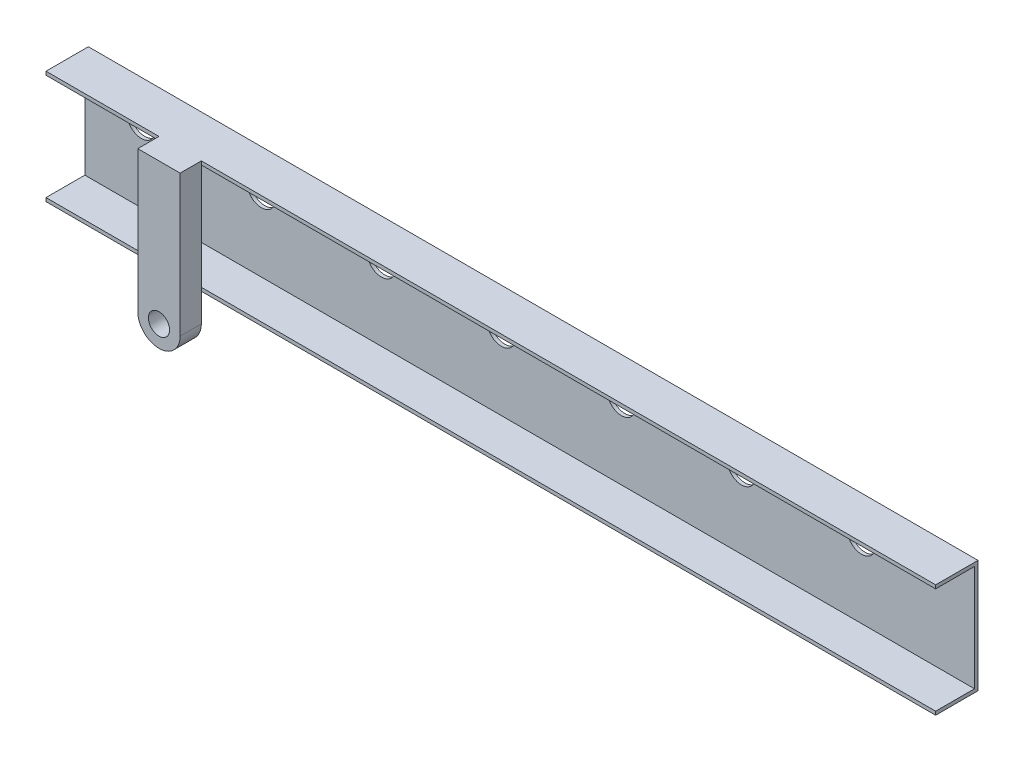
ISO-10303-21;
HEADER;
FILE_DESCRIPTION(('STEP AP214'),'2;1');
FILE_NAME('part.step','',(''),(''),'','','');
FILE_SCHEMA(('AUTOMOTIVE_DESIGN { 1 0 10303 214 1 1 1 1 }'));
ENDSEC;
DATA;
#1=APPLICATION_CONTEXT('core data for automotive mechanical design processes');
#2=APPLICATION_PROTOCOL_DEFINITION('international standard','automotive_design',2000,#1);
#3=PRODUCT_CONTEXT('',#1,'mechanical');
#4=PRODUCT('Part','Part','',(#3));
#5=PRODUCT_RELATED_PRODUCT_CATEGORY('part','',(#4));
#6=PRODUCT_DEFINITION_FORMATION('','',#4);
#7=PRODUCT_DEFINITION_CONTEXT('part definition',#1,'design');
#8=PRODUCT_DEFINITION('design','',#6,#7);
#9=PRODUCT_DEFINITION_SHAPE('','',#8);
#10=(LENGTH_UNIT() NAMED_UNIT(*) SI_UNIT(.MILLI.,.METRE.));
#11=(NAMED_UNIT(*) PLANE_ANGLE_UNIT() SI_UNIT($,.RADIAN.));
#12=(NAMED_UNIT(*) SI_UNIT($,.STERADIAN.) SOLID_ANGLE_UNIT());
#13=UNCERTAINTY_MEASURE_WITH_UNIT(LENGTH_MEASURE(1.E-05),#10,'distance_accuracy_value','');
#14=(GEOMETRIC_REPRESENTATION_CONTEXT(3) GLOBAL_UNCERTAINTY_ASSIGNED_CONTEXT((#13)) GLOBAL_UNIT_ASSIGNED_CONTEXT((#10,
#11,#12)) REPRESENTATION_CONTEXT('',''));
#15=CARTESIAN_POINT('',(0.,0.,0.));
#16=DIRECTION('',(0.,0.,1.));
#17=DIRECTION('',(1.,0.,0.));
#18=AXIS2_PLACEMENT_3D('',#15,#16,#17);
#19=CARTESIAN_POINT('',(800.1,-3.17499999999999,38.1));
#20=DIRECTION('',(0.,0.,1.));
#21=DIRECTION('',(1.,0.,0.));
#22=AXIS2_PLACEMENT_3D('',#19,#20,#21);
#23=PLANE('',#22);
#24=DIRECTION('',(-1.,0.,0.));
#25=VECTOR('',#24,1.);
#26=CARTESIAN_POINT('',(800.1,-3.17499999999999,38.1));
#27=LINE('',#26,#25);
#28=CARTESIAN_POINT('',(101.6,-3.17499999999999,38.1));
#29=VERTEX_POINT('',#28);
#30=CARTESIAN_POINT('',(0.,-3.17499999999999,38.1));
#31=VERTEX_POINT('',#30);
#32=EDGE_CURVE('E36',#29,#31,#27,.T.);
#33=ORIENTED_EDGE('',*,*,#32,.F.);
#34=DIRECTION('',(0.,-1.,0.));
#35=VECTOR('',#34,1.);
#36=CARTESIAN_POINT('',(101.6,0.,38.1000000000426));
#37=LINE('',#36,#35);
#38=CARTESIAN_POINT('',(101.6,0.,38.1000000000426));
#39=VERTEX_POINT('',#38);
#40=EDGE_CURVE('E150',#39,#29,#37,.T.);
#41=ORIENTED_EDGE('',*,*,#40,.F.);
#42=DIRECTION('',(-1.,0.,0.));
#43=VECTOR('',#42,1.);
#44=CARTESIAN_POINT('',(800.1,0.,38.1));
#45=LINE('',#44,#43);
#46=CARTESIAN_POINT('',(0.,0.,38.1));
#47=VERTEX_POINT('',#46);
#48=EDGE_CURVE('E278',#39,#47,#45,.T.);
#49=ORIENTED_EDGE('',*,*,#48,.T.);
#50=DIRECTION('',(0.,1.,0.));
#51=VECTOR('',#50,1.);
#52=CARTESIAN_POINT('',(0.,-3.17499999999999,38.1));
#53=LINE('',#52,#51);
#54=EDGE_CURVE('E236',#31,#47,#53,.T.);
#55=ORIENTED_EDGE('',*,*,#54,.F.);
#56=EDGE_LOOP('',(#33,#41,#49,#55));
#57=FACE_BOUND('',#56,.T.);
#58=ADVANCED_FACE('F28',(#57),#23,.T.);
#59=CARTESIAN_POINT('',(800.1,0.,38.1));
#60=VERTEX_POINT('',#59);
#61=CARTESIAN_POINT('',(139.7,0.,38.1));
#62=VERTEX_POINT('',#61);
#63=EDGE_CURVE('E31',#60,#62,#45,.T.);
#64=ORIENTED_EDGE('',*,*,#63,.T.);
#65=DIRECTION('',(0.,1.,0.));
#66=VECTOR('',#65,1.);
#67=CARTESIAN_POINT('',(139.7,-127.,38.1000000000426));
#68=LINE('',#67,#66);
#69=CARTESIAN_POINT('',(139.7,-3.17499999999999,38.1));
#70=VERTEX_POINT('',#69);
#71=EDGE_CURVE('E51',#70,#62,#68,.T.);
#72=ORIENTED_EDGE('',*,*,#71,.F.);
#73=CARTESIAN_POINT('',(800.1,-3.17499999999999,38.1));
#74=VERTEX_POINT('',#73);
#75=EDGE_CURVE('E11',#74,#70,#27,.T.);
#76=ORIENTED_EDGE('',*,*,#75,.F.);
#77=DIRECTION('',(0.,1.,0.));
#78=VECTOR('',#77,1.);
#79=CARTESIAN_POINT('',(800.1,-3.17499999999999,38.1));
#80=LINE('',#79,#78);
#81=EDGE_CURVE('E259',#74,#60,#80,.T.);
#82=ORIENTED_EDGE('',*,*,#81,.T.);
#83=EDGE_LOOP('',(#64,#72,#76,#82));
#84=FACE_BOUND('',#83,.T.);
#85=ADVANCED_FACE('F349',(#84),#23,.T.);
#86=CARTESIAN_POINT('',(800.1,-98.425,38.1));
#87=DIRECTION('',(0.,0.,-1.));
#88=DIRECTION('',(-1.,0.,0.));
#89=AXIS2_PLACEMENT_3D('',#86,#87,#88);
#90=PLANE('',#89);
#91=CARTESIAN_POINT('',(101.6,-98.425,38.1000000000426));
#92=VERTEX_POINT('',#91);
#93=CARTESIAN_POINT('',(101.6,-101.6,38.1));
#94=VERTEX_POINT('',#93);
#95=EDGE_CURVE('E144',#92,#94,#37,.T.);
#96=ORIENTED_EDGE('',*,*,#95,.F.);
#97=DIRECTION('',(-1.,0.,0.));
#98=VECTOR('',#97,1.);
#99=CARTESIAN_POINT('',(800.1,-98.425,38.1));
#100=LINE('',#99,#98);
#101=CARTESIAN_POINT('',(0.,-98.425,38.1));
#102=VERTEX_POINT('',#101);
#103=EDGE_CURVE('E288',#92,#102,#100,.T.);
#104=ORIENTED_EDGE('',*,*,#103,.T.);
#105=DIRECTION('',(0.,-1.,0.));
#106=VECTOR('',#105,1.);
#107=CARTESIAN_POINT('',(0.,-98.425,38.1));
#108=LINE('',#107,#106);
#109=CARTESIAN_POINT('',(0.,-101.6,38.1));
#110=VERTEX_POINT('',#109);
#111=EDGE_CURVE('E248',#102,#110,#108,.T.);
#112=ORIENTED_EDGE('',*,*,#111,.T.);
#113=DIRECTION('',(-1.,0.,0.));
#114=VECTOR('',#113,1.);
#115=CARTESIAN_POINT('',(800.1,-101.6,38.1));
#116=LINE('',#115,#114);
#117=EDGE_CURVE('E292',#94,#110,#116,.T.);
#118=ORIENTED_EDGE('',*,*,#117,.F.);
#119=EDGE_LOOP('',(#96,#104,#112,#118));
#120=FACE_BOUND('',#119,.T.);
#121=ADVANCED_FACE('F343',(#120),#90,.F.);
#122=CARTESIAN_POINT('',(139.7,-101.6,38.1000000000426));
#123=VERTEX_POINT('',#122);
#124=CARTESIAN_POINT('',(139.7,-98.425,38.1000000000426));
#125=VERTEX_POINT('',#124);
#126=EDGE_CURVE('E172',#123,#125,#68,.T.);
#127=ORIENTED_EDGE('',*,*,#126,.F.);
#128=CARTESIAN_POINT('',(800.1,-101.6,38.1));
#129=VERTEX_POINT('',#128);
#130=EDGE_CURVE('E289',#129,#123,#116,.T.);
#131=ORIENTED_EDGE('',*,*,#130,.F.);
#132=DIRECTION('',(0.,-1.,0.));
#133=VECTOR('',#132,1.);
#134=CARTESIAN_POINT('',(800.1,-98.425,38.1));
#135=LINE('',#134,#133);
#136=CARTESIAN_POINT('',(800.1,-98.425,38.1));
#137=VERTEX_POINT('',#136);
#138=EDGE_CURVE('E270',#137,#129,#135,.T.);
#139=ORIENTED_EDGE('',*,*,#138,.F.);
#140=EDGE_CURVE('E285',#137,#125,#100,.T.);
#141=ORIENTED_EDGE('',*,*,#140,.T.);
#142=EDGE_LOOP('',(#127,#131,#139,#141));
#143=FACE_BOUND('',#142,.T.);
#144=ADVANCED_FACE('F331',(#143),#90,.F.);
#145=CARTESIAN_POINT('',(800.1,-3.175,0.));
#146=DIRECTION('',(0.,-1.,0.));
#147=DIRECTION('',(0.,0.,-1.));
#148=AXIS2_PLACEMENT_3D('',#145,#146,#147);
#149=PLANE('',#148);
#150=DIRECTION('',(0.,0.,1.));
#151=VECTOR('',#150,1.);
#152=CARTESIAN_POINT('',(0.,-3.175,0.));
#153=LINE('',#152,#151);
#154=CARTESIAN_POINT('',(0.,-3.175,3.175));
#155=VERTEX_POINT('',#154);
#156=EDGE_CURVE('E256',#155,#31,#153,.T.);
#157=ORIENTED_EDGE('',*,*,#156,.F.);
#158=DIRECTION('',(-1.,0.,0.));
#159=VECTOR('',#158,1.);
#160=CARTESIAN_POINT('',(800.1,-3.175,3.175));
#161=LINE('',#160,#159);
#162=CARTESIAN_POINT('',(800.1,-3.175,3.175));
#163=VERTEX_POINT('',#162);
#164=EDGE_CURVE('E280',#163,#155,#161,.T.);
#165=ORIENTED_EDGE('',*,*,#164,.F.);
#166=DIRECTION('',(0.,0.,1.));
#167=VECTOR('',#166,1.);
#168=CARTESIAN_POINT('',(800.1,-3.175,0.));
#169=LINE('',#168,#167);
#170=EDGE_CURVE('E276',#163,#74,#169,.T.);
#171=ORIENTED_EDGE('',*,*,#170,.T.);
#172=ORIENTED_EDGE('',*,*,#75,.T.);
#173=DIRECTION('',(1.,0.,0.));
#174=VECTOR('',#173,1.);
#175=CARTESIAN_POINT('',(800.1,-3.17499999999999,38.1000000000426));
#176=LINE('',#175,#174);
#177=EDGE_CURVE('E191',#29,#70,#176,.T.);
#178=ORIENTED_EDGE('',*,*,#177,.F.);
#179=ORIENTED_EDGE('',*,*,#32,.T.);
#180=EDGE_LOOP('',(#157,#165,#171,#172,#178,#179));
#181=FACE_BOUND('',#180,.T.);
#182=ADVANCED_FACE('F307',(#181),#149,.T.);
#183=CARTESIAN_POINT('',(800.1,0.,3.175));
#184=DIRECTION('',(0.,0.,-1.));
#185=DIRECTION('',(0.,1.,0.));
#186=AXIS2_PLACEMENT_3D('',#183,#184,#185);
#187=PLANE('',#186);
#188=CARTESIAN_POINT('',(698.5,-31.75,3.175));
#189=DIRECTION('',(0.,0.,-1.));
#190=DIRECTION('',(0.,1.,0.));
#191=AXIS2_PLACEMENT_3D('',#188,#189,#190);
#192=CIRCLE('',#191,12.7);
#193=CARTESIAN_POINT('',(698.5,-19.05,3.175));
#194=VERTEX_POINT('',#193);
#195=EDGE_CURVE('E197',#194,#194,#192,.T.);
#196=ORIENTED_EDGE('',*,*,#195,.T.);
#197=EDGE_LOOP('',(#196));
#198=FACE_BOUND('',#197,.T.);
#199=CARTESIAN_POINT('',(590.55,-31.75,3.175));
#200=DIRECTION('',(0.,0.,-1.));
#201=DIRECTION('',(0.,1.,0.));
#202=AXIS2_PLACEMENT_3D('',#199,#200,#201);
#203=CIRCLE('',#202,12.7);
#204=CARTESIAN_POINT('',(590.55,-19.05,3.175));
#205=VERTEX_POINT('',#204);
#206=EDGE_CURVE('E203',#205,#205,#203,.T.);
#207=ORIENTED_EDGE('',*,*,#206,.T.);
#208=EDGE_LOOP('',(#207));
#209=FACE_BOUND('',#208,.T.);
#210=CARTESIAN_POINT('',(482.6,-31.75,3.175));
#211=DIRECTION('',(0.,0.,-1.));
#212=DIRECTION('',(0.,1.,0.));
#213=AXIS2_PLACEMENT_3D('',#210,#211,#212);
#214=CIRCLE('',#213,12.7);
#215=CARTESIAN_POINT('',(482.6,-19.05,3.175));
#216=VERTEX_POINT('',#215);
#217=EDGE_CURVE('E209',#216,#216,#214,.T.);
#218=ORIENTED_EDGE('',*,*,#217,.T.);
#219=EDGE_LOOP('',(#218));
#220=FACE_BOUND('',#219,.T.);
#221=CARTESIAN_POINT('',(374.65,-31.75,3.175));
#222=DIRECTION('',(0.,0.,-1.));
#223=DIRECTION('',(0.,1.,0.));
#224=AXIS2_PLACEMENT_3D('',#221,#222,#223);
#225=CIRCLE('',#224,12.7);
#226=CARTESIAN_POINT('',(374.65,-19.05,3.175));
#227=VERTEX_POINT('',#226);
#228=EDGE_CURVE('E215',#227,#227,#225,.T.);
#229=ORIENTED_EDGE('',*,*,#228,.T.);
#230=EDGE_LOOP('',(#229));
#231=FACE_BOUND('',#230,.T.);
#232=CARTESIAN_POINT('',(266.7,-31.75,3.175));
#233=DIRECTION('',(0.,0.,-1.));
#234=DIRECTION('',(0.,1.,0.));
#235=AXIS2_PLACEMENT_3D('',#232,#233,#234);
#236=CIRCLE('',#235,12.7);
#237=CARTESIAN_POINT('',(266.7,-19.05,3.175));
#238=VERTEX_POINT('',#237);
#239=EDGE_CURVE('E221',#238,#238,#236,.T.);
#240=ORIENTED_EDGE('',*,*,#239,.T.);
#241=EDGE_LOOP('',(#240));
#242=FACE_BOUND('',#241,.T.);
#243=CARTESIAN_POINT('',(158.75,-31.75,3.175));
#244=DIRECTION('',(0.,0.,-1.));
#245=DIRECTION('',(0.,1.,0.));
#246=AXIS2_PLACEMENT_3D('',#243,#244,#245);
#247=CIRCLE('',#246,12.7);
#248=CARTESIAN_POINT('',(158.75,-19.05,3.175));
#249=VERTEX_POINT('',#248);
#250=EDGE_CURVE('E227',#249,#249,#247,.T.);
#251=ORIENTED_EDGE('',*,*,#250,.T.);
#252=EDGE_LOOP('',(#251));
#253=FACE_BOUND('',#252,.T.);
#254=CARTESIAN_POINT('',(50.8,-31.75,3.175));
#255=DIRECTION('',(0.,0.,-1.));
#256=DIRECTION('',(0.,1.,0.));
#257=AXIS2_PLACEMENT_3D('',#254,#255,#256);
#258=CIRCLE('',#257,12.7);
#259=CARTESIAN_POINT('',(50.8,-19.05,3.175));
#260=VERTEX_POINT('',#259);
#261=EDGE_CURVE('E233',#260,#260,#258,.T.);
#262=ORIENTED_EDGE('',*,*,#261,.T.);
#263=EDGE_LOOP('',(#262));
#264=FACE_BOUND('',#263,.T.);
#265=DIRECTION('',(0.,-1.,0.));
#266=VECTOR('',#265,1.);
#267=CARTESIAN_POINT('',(0.,0.,3.175));
#268=LINE('',#267,#266);
#269=CARTESIAN_POINT('',(0.,-98.425,3.17499999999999));
#270=VERTEX_POINT('',#269);
#271=EDGE_CURVE('E254',#155,#270,#268,.T.);
#272=ORIENTED_EDGE('',*,*,#271,.T.);
#273=DIRECTION('',(-1.,0.,0.));
#274=VECTOR('',#273,1.);
#275=CARTESIAN_POINT('',(800.1,-98.425,3.17499999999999));
#276=LINE('',#275,#274);
#277=CARTESIAN_POINT('',(800.1,-98.425,3.17499999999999));
#278=VERTEX_POINT('',#277);
#279=EDGE_CURVE('E282',#278,#270,#276,.T.);
#280=ORIENTED_EDGE('',*,*,#279,.F.);
#281=DIRECTION('',(0.,-1.,0.));
#282=VECTOR('',#281,1.);
#283=CARTESIAN_POINT('',(800.1,0.,3.175));
#284=LINE('',#283,#282);
#285=EDGE_CURVE('E274',#163,#278,#284,.T.);
#286=ORIENTED_EDGE('',*,*,#285,.F.);
#287=ORIENTED_EDGE('',*,*,#164,.T.);
#288=EDGE_LOOP('',(#272,#280,#286,#287));
#289=FACE_BOUND('',#288,.T.);
#290=ADVANCED_FACE('F422',(#198,#209,#220,#231,#242,#253,#264,#289),#187,.F.);
#291=CARTESIAN_POINT('',(800.1,-98.425,0.));
#292=DIRECTION('',(0.,-1.,0.));
#293=DIRECTION('',(0.,0.,-1.));
#294=AXIS2_PLACEMENT_3D('',#291,#292,#293);
#295=PLANE('',#294);
#296=DIRECTION('',(0.,0.,-1.));
#297=VECTOR('',#296,1.);
#298=CARTESIAN_POINT('',(0.,-98.425,0.));
#299=LINE('',#298,#297);
#300=EDGE_CURVE('E251',#270,#102,#299,.F.);
#301=ORIENTED_EDGE('',*,*,#300,.T.);
#302=ORIENTED_EDGE('',*,*,#103,.F.);
#303=DIRECTION('',(1.,0.,0.));
#304=VECTOR('',#303,1.);
#305=CARTESIAN_POINT('',(800.1,-98.425,38.1000000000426));
#306=LINE('',#305,#304);
#307=EDGE_CURVE('E188',#92,#125,#306,.T.);
#308=ORIENTED_EDGE('',*,*,#307,.T.);
#309=ORIENTED_EDGE('',*,*,#140,.F.);
#310=DIRECTION('',(0.,0.,-1.));
#311=VECTOR('',#310,1.);
#312=CARTESIAN_POINT('',(800.1,-98.425,0.));
#313=LINE('',#312,#311);
#314=EDGE_CURVE('E272',#278,#137,#313,.F.);
#315=ORIENTED_EDGE('',*,*,#314,.F.);
#316=ORIENTED_EDGE('',*,*,#279,.T.);
#317=EDGE_LOOP('',(#301,#302,#308,#309,#315,#316));
#318=FACE_BOUND('',#317,.T.);
#319=ADVANCED_FACE('F328',(#318),#295,.F.);
#320=CARTESIAN_POINT('',(800.1,-101.6,0.));
#321=DIRECTION('',(0.,-1.,0.));
#322=DIRECTION('',(0.,0.,-1.));
#323=AXIS2_PLACEMENT_3D('',#320,#321,#322);
#324=PLANE('',#323);
#325=DIRECTION('',(0.,0.,1.));
#326=VECTOR('',#325,1.);
#327=CARTESIAN_POINT('',(0.,-101.6,0.));
#328=LINE('',#327,#326);
#329=CARTESIAN_POINT('',(0.,-101.6,0.));
#330=VERTEX_POINT('',#329);
#331=EDGE_CURVE('E245',#330,#110,#328,.T.);
#332=ORIENTED_EDGE('',*,*,#331,.F.);
#333=DIRECTION('',(-1.,0.,0.));
#334=VECTOR('',#333,1.);
#335=CARTESIAN_POINT('',(800.1,-101.6,0.));
#336=LINE('',#335,#334);
#337=CARTESIAN_POINT('',(800.1,-101.6,0.));
#338=VERTEX_POINT('',#337);
#339=EDGE_CURVE('E293',#338,#330,#336,.T.);
#340=ORIENTED_EDGE('',*,*,#339,.F.);
#341=DIRECTION('',(0.,0.,1.));
#342=VECTOR('',#341,1.);
#343=CARTESIAN_POINT('',(800.1,-101.6,0.));
#344=LINE('',#343,#342);
#345=EDGE_CURVE('E267',#338,#129,#344,.T.);
#346=ORIENTED_EDGE('',*,*,#345,.T.);
#347=ORIENTED_EDGE('',*,*,#130,.T.);
#348=DIRECTION('',(1.,0.,0.));
#349=VECTOR('',#348,1.);
#350=CARTESIAN_POINT('',(800.1,-101.6,38.1000000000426));
#351=LINE('',#350,#349);
#352=EDGE_CURVE('E157',#94,#123,#351,.T.);
#353=ORIENTED_EDGE('',*,*,#352,.F.);
#354=ORIENTED_EDGE('',*,*,#117,.T.);
#355=EDGE_LOOP('',(#332,#340,#346,#347,#353,#354));
#356=FACE_BOUND('',#355,.T.);
#357=ADVANCED_FACE('F346',(#356),#324,.T.);
#358=CARTESIAN_POINT('',(800.1,0.,0.));
#359=DIRECTION('',(0.,0.,-1.));
#360=DIRECTION('',(0.,1.,0.));
#361=AXIS2_PLACEMENT_3D('',#358,#359,#360);
#362=PLANE('',#361);
#363=CARTESIAN_POINT('',(698.5,-31.75,0.));
#364=DIRECTION('',(0.,0.,-1.));
#365=DIRECTION('',(0.,1.,0.));
#366=AXIS2_PLACEMENT_3D('',#363,#364,#365);
#367=CIRCLE('',#366,12.7);
#368=CARTESIAN_POINT('',(698.5,-19.05,0.));
#369=VERTEX_POINT('',#368);
#370=EDGE_CURVE('E194',#369,#369,#367,.T.);
#371=ORIENTED_EDGE('',*,*,#370,.F.);
#372=EDGE_LOOP('',(#371));
#373=FACE_BOUND('',#372,.T.);
#374=CARTESIAN_POINT('',(590.55,-31.75,0.));
#375=DIRECTION('',(0.,0.,-1.));
#376=DIRECTION('',(0.,1.,0.));
#377=AXIS2_PLACEMENT_3D('',#374,#375,#376);
#378=CIRCLE('',#377,12.7);
#379=CARTESIAN_POINT('',(590.55,-19.05,0.));
#380=VERTEX_POINT('',#379);
#381=EDGE_CURVE('E200',#380,#380,#378,.T.);
#382=ORIENTED_EDGE('',*,*,#381,.F.);
#383=EDGE_LOOP('',(#382));
#384=FACE_BOUND('',#383,.T.);
#385=CARTESIAN_POINT('',(482.6,-31.75,0.));
#386=DIRECTION('',(0.,0.,-1.));
#387=DIRECTION('',(0.,1.,0.));
#388=AXIS2_PLACEMENT_3D('',#385,#386,#387);
#389=CIRCLE('',#388,12.7);
#390=CARTESIAN_POINT('',(482.6,-19.05,0.));
#391=VERTEX_POINT('',#390);
#392=EDGE_CURVE('E206',#391,#391,#389,.T.);
#393=ORIENTED_EDGE('',*,*,#392,.F.);
#394=EDGE_LOOP('',(#393));
#395=FACE_BOUND('',#394,.T.);
#396=CARTESIAN_POINT('',(374.65,-31.75,0.));
#397=DIRECTION('',(0.,0.,-1.));
#398=DIRECTION('',(0.,1.,0.));
#399=AXIS2_PLACEMENT_3D('',#396,#397,#398);
#400=CIRCLE('',#399,12.7);
#401=CARTESIAN_POINT('',(374.65,-19.05,0.));
#402=VERTEX_POINT('',#401);
#403=EDGE_CURVE('E212',#402,#402,#400,.T.);
#404=ORIENTED_EDGE('',*,*,#403,.F.);
#405=EDGE_LOOP('',(#404));
#406=FACE_BOUND('',#405,.T.);
#407=CARTESIAN_POINT('',(266.7,-31.75,0.));
#408=DIRECTION('',(0.,0.,-1.));
#409=DIRECTION('',(0.,1.,0.));
#410=AXIS2_PLACEMENT_3D('',#407,#408,#409);
#411=CIRCLE('',#410,12.7);
#412=CARTESIAN_POINT('',(266.7,-19.05,0.));
#413=VERTEX_POINT('',#412);
#414=EDGE_CURVE('E218',#413,#413,#411,.T.);
#415=ORIENTED_EDGE('',*,*,#414,.F.);
#416=EDGE_LOOP('',(#415));
#417=FACE_BOUND('',#416,.T.);
#418=CARTESIAN_POINT('',(158.75,-31.75,0.));
#419=DIRECTION('',(0.,0.,-1.));
#420=DIRECTION('',(0.,1.,0.));
#421=AXIS2_PLACEMENT_3D('',#418,#419,#420);
#422=CIRCLE('',#421,12.7);
#423=CARTESIAN_POINT('',(158.75,-19.05,0.));
#424=VERTEX_POINT('',#423);
#425=EDGE_CURVE('E224',#424,#424,#422,.T.);
#426=ORIENTED_EDGE('',*,*,#425,.F.);
#427=EDGE_LOOP('',(#426));
#428=FACE_BOUND('',#427,.T.);
#429=CARTESIAN_POINT('',(50.8,-31.75,0.));
#430=DIRECTION('',(0.,0.,-1.));
#431=DIRECTION('',(0.,1.,0.));
#432=AXIS2_PLACEMENT_3D('',#429,#430,#431);
#433=CIRCLE('',#432,12.7);
#434=CARTESIAN_POINT('',(50.8,-19.05,0.));
#435=VERTEX_POINT('',#434);
#436=EDGE_CURVE('E230',#435,#435,#433,.T.);
#437=ORIENTED_EDGE('',*,*,#436,.F.);
#438=EDGE_LOOP('',(#437));
#439=FACE_BOUND('',#438,.T.);
#440=DIRECTION('',(0.,-1.,0.));
#441=VECTOR('',#440,1.);
#442=CARTESIAN_POINT('',(0.,0.,0.));
#443=LINE('',#442,#441);
#444=CARTESIAN_POINT('',(0.,0.,0.));
#445=VERTEX_POINT('',#444);
#446=EDGE_CURVE('E242',#445,#330,#443,.T.);
#447=ORIENTED_EDGE('',*,*,#446,.F.);
#448=DIRECTION('',(-1.,0.,0.));
#449=VECTOR('',#448,1.);
#450=CARTESIAN_POINT('',(800.1,0.,0.));
#451=LINE('',#450,#449);
#452=CARTESIAN_POINT('',(800.1,0.,0.));
#453=VERTEX_POINT('',#452);
#454=EDGE_CURVE('E294',#453,#445,#451,.T.);
#455=ORIENTED_EDGE('',*,*,#454,.F.);
#456=DIRECTION('',(0.,-1.,0.));
#457=VECTOR('',#456,1.);
#458=CARTESIAN_POINT('',(800.1,0.,0.));
#459=LINE('',#458,#457);
#460=EDGE_CURVE('E264',#453,#338,#459,.T.);
#461=ORIENTED_EDGE('',*,*,#460,.T.);
#462=ORIENTED_EDGE('',*,*,#339,.T.);
#463=EDGE_LOOP('',(#447,#455,#461,#462));
#464=FACE_BOUND('',#463,.T.);
#465=ADVANCED_FACE('F348',(#373,#384,#395,#406,#417,#428,#439,#464),#362,.T.);
#466=CARTESIAN_POINT('',(800.1,0.,0.));
#467=DIRECTION('',(0.,-1.,0.));
#468=DIRECTION('',(0.,0.,-1.));
#469=AXIS2_PLACEMENT_3D('',#466,#467,#468);
#470=PLANE('',#469);
#471=DIRECTION('',(0.,0.,1.));
#472=VECTOR('',#471,1.);
#473=CARTESIAN_POINT('',(0.,0.,0.));
#474=LINE('',#473,#472);
#475=EDGE_CURVE('E239',#445,#47,#474,.T.);
#476=ORIENTED_EDGE('',*,*,#475,.T.);
#477=ORIENTED_EDGE('',*,*,#48,.F.);
#478=DIRECTION('',(0.,0.,-1.));
#479=VECTOR('',#478,1.);
#480=CARTESIAN_POINT('',(101.6,0.,57.1500000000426));
#481=LINE('',#480,#479);
#482=CARTESIAN_POINT('',(101.6,0.,57.1500000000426));
#483=VERTEX_POINT('',#482);
#484=EDGE_CURVE('E180',#483,#39,#481,.T.);
#485=ORIENTED_EDGE('',*,*,#484,.F.);
#486=DIRECTION('',(1.,0.,0.));
#487=VECTOR('',#486,1.);
#488=CARTESIAN_POINT('',(101.6,0.,57.1500000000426));
#489=LINE('',#488,#487);
#490=CARTESIAN_POINT('',(139.7,0.,57.1500000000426));
#491=VERTEX_POINT('',#490);
#492=EDGE_CURVE('E177',#483,#491,#489,.T.);
#493=ORIENTED_EDGE('',*,*,#492,.T.);
#494=DIRECTION('',(0.,0.,-1.));
#495=VECTOR('',#494,1.);
#496=CARTESIAN_POINT('',(139.7,0.,57.1500000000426));
#497=LINE('',#496,#495);
#498=EDGE_CURVE('E183',#491,#62,#497,.T.);
#499=ORIENTED_EDGE('',*,*,#498,.T.);
#500=ORIENTED_EDGE('',*,*,#63,.F.);
#501=DIRECTION('',(0.,0.,1.));
#502=VECTOR('',#501,1.);
#503=CARTESIAN_POINT('',(800.1,0.,0.));
#504=LINE('',#503,#502);
#505=EDGE_CURVE('E262',#453,#60,#504,.T.);
#506=ORIENTED_EDGE('',*,*,#505,.F.);
#507=ORIENTED_EDGE('',*,*,#454,.T.);
#508=EDGE_LOOP('',(#476,#477,#485,#493,#499,#500,#506,#507));
#509=FACE_BOUND('',#508,.T.);
#510=ADVANCED_FACE('F299',(#509),#470,.F.);
#511=CARTESIAN_POINT('',(800.1,-101.6,38.1));
#512=DIRECTION('',(1.,0.,0.));
#513=DIRECTION('',(0.,0.,-1.));
#514=AXIS2_PLACEMENT_3D('',#511,#512,#513);
#515=PLANE('',#514);
#516=ORIENTED_EDGE('',*,*,#81,.F.);
#517=ORIENTED_EDGE('',*,*,#170,.F.);
#518=ORIENTED_EDGE('',*,*,#285,.T.);
#519=ORIENTED_EDGE('',*,*,#314,.T.);
#520=ORIENTED_EDGE('',*,*,#138,.T.);
#521=ORIENTED_EDGE('',*,*,#345,.F.);
#522=ORIENTED_EDGE('',*,*,#460,.F.);
#523=ORIENTED_EDGE('',*,*,#505,.T.);
#524=EDGE_LOOP('',(#516,#517,#518,#519,#520,#521,#522,#523));
#525=FACE_BOUND('',#524,.T.);
#526=ADVANCED_FACE('F335',(#525),#515,.T.);
#527=CARTESIAN_POINT('',(0.,-101.6,38.1));
#528=DIRECTION('',(1.,0.,0.));
#529=DIRECTION('',(0.,0.,-1.));
#530=AXIS2_PLACEMENT_3D('',#527,#528,#529);
#531=PLANE('',#530);
#532=ORIENTED_EDGE('',*,*,#54,.T.);
#533=ORIENTED_EDGE('',*,*,#475,.F.);
#534=ORIENTED_EDGE('',*,*,#446,.T.);
#535=ORIENTED_EDGE('',*,*,#331,.T.);
#536=ORIENTED_EDGE('',*,*,#111,.F.);
#537=ORIENTED_EDGE('',*,*,#300,.F.);
#538=ORIENTED_EDGE('',*,*,#271,.F.);
#539=ORIENTED_EDGE('',*,*,#156,.T.);
#540=EDGE_LOOP('',(#532,#533,#534,#535,#536,#537,#538,#539));
#541=FACE_BOUND('',#540,.T.);
#542=ADVANCED_FACE('F302',(#541),#531,.F.);
#543=CARTESIAN_POINT('',(50.8,-31.75,38.1));
#544=DIRECTION('',(0.,0.,-1.));
#545=DIRECTION('',(0.,1.,0.));
#546=AXIS2_PLACEMENT_3D('',#543,#544,#545);
#547=CYLINDRICAL_SURFACE('',#546,12.7);
#548=CARTESIAN_POINT('',(50.8,-19.05,0.));
#549=CARTESIAN_POINT('',(50.8,-19.05,0.0330729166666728));
#550=CARTESIAN_POINT('',(50.8,-19.05,0.0661458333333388));
#551=CARTESIAN_POINT('',(50.8,-19.05,0.132291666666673));
#552=CARTESIAN_POINT('',(50.8,-19.05,0.165364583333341));
#553=CARTESIAN_POINT('',(50.8,-19.05,0.231510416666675));
#554=CARTESIAN_POINT('',(50.8,-19.05,0.264583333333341));
#555=CARTESIAN_POINT('',(50.8,-19.05,0.330729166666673));
#556=CARTESIAN_POINT('',(50.8,-19.05,0.363802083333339));
#557=CARTESIAN_POINT('',(50.8,-19.05,0.429947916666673));
#558=CARTESIAN_POINT('',(50.8,-19.05,0.463020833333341));
#559=CARTESIAN_POINT('',(50.8,-19.05,0.529166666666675));
#560=CARTESIAN_POINT('',(50.8,-19.05,0.562239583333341));
#561=CARTESIAN_POINT('',(50.8,-19.05,0.628385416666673));
#562=CARTESIAN_POINT('',(50.8,-19.05,0.661458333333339));
#563=CARTESIAN_POINT('',(50.8,-19.05,0.727604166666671));
#564=CARTESIAN_POINT('',(50.8,-19.05,0.760677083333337));
#565=CARTESIAN_POINT('',(50.8,-19.05,0.826822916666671));
#566=CARTESIAN_POINT('',(50.8,-19.05,0.859895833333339));
#567=CARTESIAN_POINT('',(50.8,-19.05,0.926041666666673));
#568=CARTESIAN_POINT('',(50.8,-19.05,0.959114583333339));
#569=CARTESIAN_POINT('',(50.8,-19.05,1.02526041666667));
#570=CARTESIAN_POINT('',(50.8,-19.05,1.05833333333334));
#571=CARTESIAN_POINT('',(50.8,-19.05,1.12447916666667));
#572=CARTESIAN_POINT('',(50.8,-19.05,1.15755208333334));
#573=CARTESIAN_POINT('',(50.8,-19.05,1.22369791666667));
#574=CARTESIAN_POINT('',(50.8,-19.05,1.25677083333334));
#575=CARTESIAN_POINT('',(50.8,-19.05,1.32291666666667));
#576=CARTESIAN_POINT('',(50.8,-19.05,1.35598958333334));
#577=CARTESIAN_POINT('',(50.8,-19.05,1.42213541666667));
#578=CARTESIAN_POINT('',(50.8,-19.05,1.45520833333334));
#579=CARTESIAN_POINT('',(50.8,-19.05,1.52135416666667));
#580=CARTESIAN_POINT('',(50.8,-19.05,1.55442708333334));
#581=CARTESIAN_POINT('',(50.8,-19.05,1.62057291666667));
#582=CARTESIAN_POINT('',(50.8,-19.05,1.65364583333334));
#583=CARTESIAN_POINT('',(50.8,-19.05,1.71979166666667));
#584=CARTESIAN_POINT('',(50.8,-19.05,1.75286458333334));
#585=CARTESIAN_POINT('',(50.8,-19.05,1.81901041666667));
#586=CARTESIAN_POINT('',(50.8,-19.05,1.85208333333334));
#587=CARTESIAN_POINT('',(50.8,-19.05,1.91822916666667));
#588=CARTESIAN_POINT('',(50.8,-19.05,1.95130208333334));
#589=CARTESIAN_POINT('',(50.8,-19.05,2.01744791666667));
#590=CARTESIAN_POINT('',(50.8,-19.05,2.05052083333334));
#591=CARTESIAN_POINT('',(50.8,-19.05,2.11666666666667));
#592=CARTESIAN_POINT('',(50.8,-19.05,2.14973958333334));
#593=CARTESIAN_POINT('',(50.8,-19.05,2.21588541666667));
#594=CARTESIAN_POINT('',(50.8,-19.05,2.24895833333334));
#595=CARTESIAN_POINT('',(50.8,-19.05,2.31510416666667));
#596=CARTESIAN_POINT('',(50.8,-19.05,2.34817708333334));
#597=CARTESIAN_POINT('',(50.8,-19.05,2.41432291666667));
#598=CARTESIAN_POINT('',(50.8,-19.05,2.44739583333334));
#599=CARTESIAN_POINT('',(50.8,-19.05,2.51354166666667));
#600=CARTESIAN_POINT('',(50.8,-19.05,2.54661458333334));
#601=CARTESIAN_POINT('',(50.8,-19.05,2.61276041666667));
#602=CARTESIAN_POINT('',(50.8,-19.05,2.64583333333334));
#603=CARTESIAN_POINT('',(50.8,-19.05,2.71197916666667));
#604=CARTESIAN_POINT('',(50.8,-19.05,2.74505208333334));
#605=CARTESIAN_POINT('',(50.8,-19.05,2.81119791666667));
#606=CARTESIAN_POINT('',(50.8,-19.05,2.84427083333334));
#607=CARTESIAN_POINT('',(50.8,-19.05,2.91041666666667));
#608=CARTESIAN_POINT('',(50.8,-19.05,2.94348958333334));
#609=CARTESIAN_POINT('',(50.8,-19.05,3.00963541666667));
#610=CARTESIAN_POINT('',(50.8,-19.05,3.04270833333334));
#611=CARTESIAN_POINT('',(50.8,-19.05,3.10885416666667));
#612=CARTESIAN_POINT('',(50.8,-19.05,3.14192708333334));
#613=CARTESIAN_POINT('',(50.8,-19.05,3.175));
#614=B_SPLINE_CURVE_WITH_KNOTS('',3,(#548,#549,#550,#551,#552,#553,#554,#555,#556,#557,#558,
#559,#560,#561,#562,#563,#564,#565,#566,#567,#568,#569,#570,#571,#572,#573,#574,#575,#576,#577,
#578,#579,#580,#581,#582,#583,#584,#585,#586,#587,#588,#589,#590,#591,#592,#593,#594,#595,#596,
#597,#598,#599,#600,#601,#602,#603,#604,#605,#606,#607,#608,#609,#610,#611,#612,#613),
.UNSPECIFIED.,.F.,.F.,(4,2,2,2,2,2,2,2,2,2,2,2,2,2,2,2,2,2,2,2,2,2,2,2,2,2,2,2,2,2,2,2,4),(0.,
0.0992187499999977,0.198437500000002,0.29765625,0.396874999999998,0.496093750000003,0.5953125,
0.694531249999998,0.793749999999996,0.892968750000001,0.992187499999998,1.09140625,1.190625,
1.28984375,1.3890625,1.48828125,1.5875,1.68671875,1.7859375,1.88515625,1.984375,2.08359375,
2.1828125,2.28203125,2.38125,2.48046875,2.5796875,2.67890624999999,2.778125,2.87734375,
2.97656249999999,3.07578125,3.175),.UNSPECIFIED.);
#615=EDGE_CURVE('BSEAM407',#435,#260,#614,.T.);
#616=ORIENTED_EDGE('',*,*,#436,.T.);
#617=ORIENTED_EDGE('',*,*,#261,.F.);
#618=ORIENTED_EDGE('',*,*,#615,.T.);
#619=ORIENTED_EDGE('',*,*,#615,.F.);
#620=EDGE_LOOP('',(#616,#618,#617,#619));
#621=FACE_BOUND('',#620,.T.);
#622=ADVANCED_FACE('F407',(#621),#547,.F.);
#623=CARTESIAN_POINT('',(158.75,-31.75,38.1));
#624=DIRECTION('',(0.,0.,-1.));
#625=DIRECTION('',(0.,1.,0.));
#626=AXIS2_PLACEMENT_3D('',#623,#624,#625);
#627=CYLINDRICAL_SURFACE('',#626,12.7);
#628=CARTESIAN_POINT('',(158.75,-19.05,0.));
#629=CARTESIAN_POINT('',(158.75,-19.05,0.0330729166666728));
#630=CARTESIAN_POINT('',(158.75,-19.05,0.0661458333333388));
#631=CARTESIAN_POINT('',(158.75,-19.05,0.132291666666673));
#632=CARTESIAN_POINT('',(158.75,-19.05,0.165364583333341));
#633=CARTESIAN_POINT('',(158.75,-19.05,0.231510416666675));
#634=CARTESIAN_POINT('',(158.75,-19.05,0.264583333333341));
#635=CARTESIAN_POINT('',(158.75,-19.05,0.330729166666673));
#636=CARTESIAN_POINT('',(158.75,-19.05,0.363802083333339));
#637=CARTESIAN_POINT('',(158.75,-19.05,0.429947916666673));
#638=CARTESIAN_POINT('',(158.75,-19.05,0.463020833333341));
#639=CARTESIAN_POINT('',(158.75,-19.05,0.529166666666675));
#640=CARTESIAN_POINT('',(158.75,-19.05,0.562239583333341));
#641=CARTESIAN_POINT('',(158.75,-19.05,0.628385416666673));
#642=CARTESIAN_POINT('',(158.75,-19.05,0.661458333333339));
#643=CARTESIAN_POINT('',(158.75,-19.05,0.727604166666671));
#644=CARTESIAN_POINT('',(158.75,-19.05,0.760677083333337));
#645=CARTESIAN_POINT('',(158.75,-19.05,0.826822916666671));
#646=CARTESIAN_POINT('',(158.75,-19.05,0.859895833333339));
#647=CARTESIAN_POINT('',(158.75,-19.05,0.926041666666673));
#648=CARTESIAN_POINT('',(158.75,-19.05,0.959114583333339));
#649=CARTESIAN_POINT('',(158.75,-19.05,1.02526041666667));
#650=CARTESIAN_POINT('',(158.75,-19.05,1.05833333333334));
#651=CARTESIAN_POINT('',(158.75,-19.05,1.12447916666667));
#652=CARTESIAN_POINT('',(158.75,-19.05,1.15755208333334));
#653=CARTESIAN_POINT('',(158.75,-19.05,1.22369791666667));
#654=CARTESIAN_POINT('',(158.75,-19.05,1.25677083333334));
#655=CARTESIAN_POINT('',(158.75,-19.05,1.32291666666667));
#656=CARTESIAN_POINT('',(158.75,-19.05,1.35598958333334));
#657=CARTESIAN_POINT('',(158.75,-19.05,1.42213541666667));
#658=CARTESIAN_POINT('',(158.75,-19.05,1.45520833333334));
#659=CARTESIAN_POINT('',(158.75,-19.05,1.52135416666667));
#660=CARTESIAN_POINT('',(158.75,-19.05,1.55442708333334));
#661=CARTESIAN_POINT('',(158.75,-19.05,1.62057291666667));
#662=CARTESIAN_POINT('',(158.75,-19.05,1.65364583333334));
#663=CARTESIAN_POINT('',(158.75,-19.05,1.71979166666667));
#664=CARTESIAN_POINT('',(158.75,-19.05,1.75286458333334));
#665=CARTESIAN_POINT('',(158.75,-19.05,1.81901041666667));
#666=CARTESIAN_POINT('',(158.75,-19.05,1.85208333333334));
#667=CARTESIAN_POINT('',(158.75,-19.05,1.91822916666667));
#668=CARTESIAN_POINT('',(158.75,-19.05,1.95130208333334));
#669=CARTESIAN_POINT('',(158.75,-19.05,2.01744791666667));
#670=CARTESIAN_POINT('',(158.75,-19.05,2.05052083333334));
#671=CARTESIAN_POINT('',(158.75,-19.05,2.11666666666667));
#672=CARTESIAN_POINT('',(158.75,-19.05,2.14973958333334));
#673=CARTESIAN_POINT('',(158.75,-19.05,2.21588541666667));
#674=CARTESIAN_POINT('',(158.75,-19.05,2.24895833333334));
#675=CARTESIAN_POINT('',(158.75,-19.05,2.31510416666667));
#676=CARTESIAN_POINT('',(158.75,-19.05,2.34817708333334));
#677=CARTESIAN_POINT('',(158.75,-19.05,2.41432291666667));
#678=CARTESIAN_POINT('',(158.75,-19.05,2.44739583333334));
#679=CARTESIAN_POINT('',(158.75,-19.05,2.51354166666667));
#680=CARTESIAN_POINT('',(158.75,-19.05,2.54661458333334));
#681=CARTESIAN_POINT('',(158.75,-19.05,2.61276041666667));
#682=CARTESIAN_POINT('',(158.75,-19.05,2.64583333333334));
#683=CARTESIAN_POINT('',(158.75,-19.05,2.71197916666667));
#684=CARTESIAN_POINT('',(158.75,-19.05,2.74505208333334));
#685=CARTESIAN_POINT('',(158.75,-19.05,2.81119791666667));
#686=CARTESIAN_POINT('',(158.75,-19.05,2.84427083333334));
#687=CARTESIAN_POINT('',(158.75,-19.05,2.91041666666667));
#688=CARTESIAN_POINT('',(158.75,-19.05,2.94348958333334));
#689=CARTESIAN_POINT('',(158.75,-19.05,3.00963541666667));
#690=CARTESIAN_POINT('',(158.75,-19.05,3.04270833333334));
#691=CARTESIAN_POINT('',(158.75,-19.05,3.10885416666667));
#692=CARTESIAN_POINT('',(158.75,-19.05,3.14192708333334));
#693=CARTESIAN_POINT('',(158.75,-19.05,3.175));
#694=B_SPLINE_CURVE_WITH_KNOTS('',3,(#628,#629,#630,#631,#632,#633,#634,#635,#636,#637,#638,
#639,#640,#641,#642,#643,#644,#645,#646,#647,#648,#649,#650,#651,#652,#653,#654,#655,#656,#657,
#658,#659,#660,#661,#662,#663,#664,#665,#666,#667,#668,#669,#670,#671,#672,#673,#674,#675,#676,
#677,#678,#679,#680,#681,#682,#683,#684,#685,#686,#687,#688,#689,#690,#691,#692,#693),
.UNSPECIFIED.,.F.,.F.,(4,2,2,2,2,2,2,2,2,2,2,2,2,2,2,2,2,2,2,2,2,2,2,2,2,2,2,2,2,2,2,2,4),(0.,
0.0992187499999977,0.198437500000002,0.29765625,0.396874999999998,0.496093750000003,0.5953125,
0.694531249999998,0.793749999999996,0.892968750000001,0.992187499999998,1.09140625,1.190625,
1.28984375,1.3890625,1.48828125,1.5875,1.68671875,1.7859375,1.88515625,1.984375,2.08359375,
2.1828125,2.28203125,2.38125,2.48046875,2.5796875,2.67890624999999,2.778125,2.87734375,
2.97656249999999,3.07578125,3.175),.UNSPECIFIED.);
#695=EDGE_CURVE('BSEAM399',#424,#249,#694,.T.);
#696=ORIENTED_EDGE('',*,*,#425,.T.);
#697=ORIENTED_EDGE('',*,*,#250,.F.);
#698=ORIENTED_EDGE('',*,*,#695,.T.);
#699=ORIENTED_EDGE('',*,*,#695,.F.);
#700=EDGE_LOOP('',(#696,#698,#697,#699));
#701=FACE_BOUND('',#700,.T.);
#702=ADVANCED_FACE('F399',(#701),#627,.F.);
#703=CARTESIAN_POINT('',(266.7,-31.75,38.1));
#704=DIRECTION('',(0.,0.,-1.));
#705=DIRECTION('',(0.,1.,0.));
#706=AXIS2_PLACEMENT_3D('',#703,#704,#705);
#707=CYLINDRICAL_SURFACE('',#706,12.7);
#708=CARTESIAN_POINT('',(266.7,-19.05,0.));
#709=CARTESIAN_POINT('',(266.7,-19.05,0.0330729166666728));
#710=CARTESIAN_POINT('',(266.7,-19.05,0.0661458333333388));
#711=CARTESIAN_POINT('',(266.7,-19.05,0.132291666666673));
#712=CARTESIAN_POINT('',(266.7,-19.05,0.165364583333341));
#713=CARTESIAN_POINT('',(266.7,-19.05,0.231510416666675));
#714=CARTESIAN_POINT('',(266.7,-19.05,0.264583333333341));
#715=CARTESIAN_POINT('',(266.7,-19.05,0.330729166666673));
#716=CARTESIAN_POINT('',(266.7,-19.05,0.363802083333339));
#717=CARTESIAN_POINT('',(266.7,-19.05,0.429947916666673));
#718=CARTESIAN_POINT('',(266.7,-19.05,0.463020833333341));
#719=CARTESIAN_POINT('',(266.7,-19.05,0.529166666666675));
#720=CARTESIAN_POINT('',(266.7,-19.05,0.562239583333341));
#721=CARTESIAN_POINT('',(266.7,-19.05,0.628385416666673));
#722=CARTESIAN_POINT('',(266.7,-19.05,0.661458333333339));
#723=CARTESIAN_POINT('',(266.7,-19.05,0.727604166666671));
#724=CARTESIAN_POINT('',(266.7,-19.05,0.760677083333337));
#725=CARTESIAN_POINT('',(266.7,-19.05,0.826822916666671));
#726=CARTESIAN_POINT('',(266.7,-19.05,0.859895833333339));
#727=CARTESIAN_POINT('',(266.7,-19.05,0.926041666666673));
#728=CARTESIAN_POINT('',(266.7,-19.05,0.959114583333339));
#729=CARTESIAN_POINT('',(266.7,-19.05,1.02526041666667));
#730=CARTESIAN_POINT('',(266.7,-19.05,1.05833333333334));
#731=CARTESIAN_POINT('',(266.7,-19.05,1.12447916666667));
#732=CARTESIAN_POINT('',(266.7,-19.05,1.15755208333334));
#733=CARTESIAN_POINT('',(266.7,-19.05,1.22369791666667));
#734=CARTESIAN_POINT('',(266.7,-19.05,1.25677083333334));
#735=CARTESIAN_POINT('',(266.7,-19.05,1.32291666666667));
#736=CARTESIAN_POINT('',(266.7,-19.05,1.35598958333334));
#737=CARTESIAN_POINT('',(266.7,-19.05,1.42213541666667));
#738=CARTESIAN_POINT('',(266.7,-19.05,1.45520833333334));
#739=CARTESIAN_POINT('',(266.7,-19.05,1.52135416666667));
#740=CARTESIAN_POINT('',(266.7,-19.05,1.55442708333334));
#741=CARTESIAN_POINT('',(266.7,-19.05,1.62057291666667));
#742=CARTESIAN_POINT('',(266.7,-19.05,1.65364583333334));
#743=CARTESIAN_POINT('',(266.7,-19.05,1.71979166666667));
#744=CARTESIAN_POINT('',(266.7,-19.05,1.75286458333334));
#745=CARTESIAN_POINT('',(266.7,-19.05,1.81901041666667));
#746=CARTESIAN_POINT('',(266.7,-19.05,1.85208333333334));
#747=CARTESIAN_POINT('',(266.7,-19.05,1.91822916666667));
#748=CARTESIAN_POINT('',(266.7,-19.05,1.95130208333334));
#749=CARTESIAN_POINT('',(266.7,-19.05,2.01744791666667));
#750=CARTESIAN_POINT('',(266.7,-19.05,2.05052083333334));
#751=CARTESIAN_POINT('',(266.7,-19.05,2.11666666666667));
#752=CARTESIAN_POINT('',(266.7,-19.05,2.14973958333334));
#753=CARTESIAN_POINT('',(266.7,-19.05,2.21588541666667));
#754=CARTESIAN_POINT('',(266.7,-19.05,2.24895833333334));
#755=CARTESIAN_POINT('',(266.7,-19.05,2.31510416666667));
#756=CARTESIAN_POINT('',(266.7,-19.05,2.34817708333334));
#757=CARTESIAN_POINT('',(266.7,-19.05,2.41432291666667));
#758=CARTESIAN_POINT('',(266.7,-19.05,2.44739583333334));
#759=CARTESIAN_POINT('',(266.7,-19.05,2.51354166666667));
#760=CARTESIAN_POINT('',(266.7,-19.05,2.54661458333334));
#761=CARTESIAN_POINT('',(266.7,-19.05,2.61276041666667));
#762=CARTESIAN_POINT('',(266.7,-19.05,2.64583333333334));
#763=CARTESIAN_POINT('',(266.7,-19.05,2.71197916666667));
#764=CARTESIAN_POINT('',(266.7,-19.05,2.74505208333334));
#765=CARTESIAN_POINT('',(266.7,-19.05,2.81119791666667));
#766=CARTESIAN_POINT('',(266.7,-19.05,2.84427083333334));
#767=CARTESIAN_POINT('',(266.7,-19.05,2.91041666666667));
#768=CARTESIAN_POINT('',(266.7,-19.05,2.94348958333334));
#769=CARTESIAN_POINT('',(266.7,-19.05,3.00963541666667));
#770=CARTESIAN_POINT('',(266.7,-19.05,3.04270833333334));
#771=CARTESIAN_POINT('',(266.7,-19.05,3.10885416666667));
#772=CARTESIAN_POINT('',(266.7,-19.05,3.14192708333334));
#773=CARTESIAN_POINT('',(266.7,-19.05,3.175));
#774=B_SPLINE_CURVE_WITH_KNOTS('',3,(#708,#709,#710,#711,#712,#713,#714,#715,#716,#717,#718,
#719,#720,#721,#722,#723,#724,#725,#726,#727,#728,#729,#730,#731,#732,#733,#734,#735,#736,#737,
#738,#739,#740,#741,#742,#743,#744,#745,#746,#747,#748,#749,#750,#751,#752,#753,#754,#755,#756,
#757,#758,#759,#760,#761,#762,#763,#764,#765,#766,#767,#768,#769,#770,#771,#772,#773),
.UNSPECIFIED.,.F.,.F.,(4,2,2,2,2,2,2,2,2,2,2,2,2,2,2,2,2,2,2,2,2,2,2,2,2,2,2,2,2,2,2,2,4),(0.,
0.0992187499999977,0.198437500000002,0.29765625,0.396874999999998,0.496093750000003,0.5953125,
0.694531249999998,0.793749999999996,0.892968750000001,0.992187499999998,1.09140625,1.190625,
1.28984375,1.3890625,1.48828125,1.5875,1.68671875,1.7859375,1.88515625,1.984375,2.08359375,
2.1828125,2.28203125,2.38125,2.48046875,2.5796875,2.67890624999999,2.778125,2.87734375,
2.97656249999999,3.07578125,3.175),.UNSPECIFIED.);
#775=EDGE_CURVE('BSEAM391',#413,#238,#774,.T.);
#776=ORIENTED_EDGE('',*,*,#414,.T.);
#777=ORIENTED_EDGE('',*,*,#239,.F.);
#778=ORIENTED_EDGE('',*,*,#775,.T.);
#779=ORIENTED_EDGE('',*,*,#775,.F.);
#780=EDGE_LOOP('',(#776,#778,#777,#779));
#781=FACE_BOUND('',#780,.T.);
#782=ADVANCED_FACE('F391',(#781),#707,.F.);
#783=CARTESIAN_POINT('',(374.65,-31.75,38.1));
#784=DIRECTION('',(0.,0.,-1.));
#785=DIRECTION('',(0.,1.,0.));
#786=AXIS2_PLACEMENT_3D('',#783,#784,#785);
#787=CYLINDRICAL_SURFACE('',#786,12.7);
#788=CARTESIAN_POINT('',(374.65,-19.05,0.));
#789=CARTESIAN_POINT('',(374.65,-19.05,0.0330729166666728));
#790=CARTESIAN_POINT('',(374.65,-19.05,0.0661458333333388));
#791=CARTESIAN_POINT('',(374.65,-19.05,0.132291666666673));
#792=CARTESIAN_POINT('',(374.65,-19.05,0.165364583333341));
#793=CARTESIAN_POINT('',(374.65,-19.05,0.231510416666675));
#794=CARTESIAN_POINT('',(374.65,-19.05,0.264583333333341));
#795=CARTESIAN_POINT('',(374.65,-19.05,0.330729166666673));
#796=CARTESIAN_POINT('',(374.65,-19.05,0.363802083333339));
#797=CARTESIAN_POINT('',(374.65,-19.05,0.429947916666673));
#798=CARTESIAN_POINT('',(374.65,-19.05,0.463020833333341));
#799=CARTESIAN_POINT('',(374.65,-19.05,0.529166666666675));
#800=CARTESIAN_POINT('',(374.65,-19.05,0.562239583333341));
#801=CARTESIAN_POINT('',(374.65,-19.05,0.628385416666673));
#802=CARTESIAN_POINT('',(374.65,-19.05,0.661458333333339));
#803=CARTESIAN_POINT('',(374.65,-19.05,0.727604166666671));
#804=CARTESIAN_POINT('',(374.65,-19.05,0.760677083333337));
#805=CARTESIAN_POINT('',(374.65,-19.05,0.826822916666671));
#806=CARTESIAN_POINT('',(374.65,-19.05,0.859895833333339));
#807=CARTESIAN_POINT('',(374.65,-19.05,0.926041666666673));
#808=CARTESIAN_POINT('',(374.65,-19.05,0.959114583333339));
#809=CARTESIAN_POINT('',(374.65,-19.05,1.02526041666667));
#810=CARTESIAN_POINT('',(374.65,-19.05,1.05833333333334));
#811=CARTESIAN_POINT('',(374.65,-19.05,1.12447916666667));
#812=CARTESIAN_POINT('',(374.65,-19.05,1.15755208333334));
#813=CARTESIAN_POINT('',(374.65,-19.05,1.22369791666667));
#814=CARTESIAN_POINT('',(374.65,-19.05,1.25677083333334));
#815=CARTESIAN_POINT('',(374.65,-19.05,1.32291666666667));
#816=CARTESIAN_POINT('',(374.65,-19.05,1.35598958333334));
#817=CARTESIAN_POINT('',(374.65,-19.05,1.42213541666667));
#818=CARTESIAN_POINT('',(374.65,-19.05,1.45520833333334));
#819=CARTESIAN_POINT('',(374.65,-19.05,1.52135416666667));
#820=CARTESIAN_POINT('',(374.65,-19.05,1.55442708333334));
#821=CARTESIAN_POINT('',(374.65,-19.05,1.62057291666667));
#822=CARTESIAN_POINT('',(374.65,-19.05,1.65364583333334));
#823=CARTESIAN_POINT('',(374.65,-19.05,1.71979166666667));
#824=CARTESIAN_POINT('',(374.65,-19.05,1.75286458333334));
#825=CARTESIAN_POINT('',(374.65,-19.05,1.81901041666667));
#826=CARTESIAN_POINT('',(374.65,-19.05,1.85208333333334));
#827=CARTESIAN_POINT('',(374.65,-19.05,1.91822916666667));
#828=CARTESIAN_POINT('',(374.65,-19.05,1.95130208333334));
#829=CARTESIAN_POINT('',(374.65,-19.05,2.01744791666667));
#830=CARTESIAN_POINT('',(374.65,-19.05,2.05052083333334));
#831=CARTESIAN_POINT('',(374.65,-19.05,2.11666666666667));
#832=CARTESIAN_POINT('',(374.65,-19.05,2.14973958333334));
#833=CARTESIAN_POINT('',(374.65,-19.05,2.21588541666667));
#834=CARTESIAN_POINT('',(374.65,-19.05,2.24895833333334));
#835=CARTESIAN_POINT('',(374.65,-19.05,2.31510416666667));
#836=CARTESIAN_POINT('',(374.65,-19.05,2.34817708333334));
#837=CARTESIAN_POINT('',(374.65,-19.05,2.41432291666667));
#838=CARTESIAN_POINT('',(374.65,-19.05,2.44739583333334));
#839=CARTESIAN_POINT('',(374.65,-19.05,2.51354166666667));
#840=CARTESIAN_POINT('',(374.65,-19.05,2.54661458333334));
#841=CARTESIAN_POINT('',(374.65,-19.05,2.61276041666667));
#842=CARTESIAN_POINT('',(374.65,-19.05,2.64583333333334));
#843=CARTESIAN_POINT('',(374.65,-19.05,2.71197916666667));
#844=CARTESIAN_POINT('',(374.65,-19.05,2.74505208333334));
#845=CARTESIAN_POINT('',(374.65,-19.05,2.81119791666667));
#846=CARTESIAN_POINT('',(374.65,-19.05,2.84427083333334));
#847=CARTESIAN_POINT('',(374.65,-19.05,2.91041666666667));
#848=CARTESIAN_POINT('',(374.65,-19.05,2.94348958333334));
#849=CARTESIAN_POINT('',(374.65,-19.05,3.00963541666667));
#850=CARTESIAN_POINT('',(374.65,-19.05,3.04270833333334));
#851=CARTESIAN_POINT('',(374.65,-19.05,3.10885416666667));
#852=CARTESIAN_POINT('',(374.65,-19.05,3.14192708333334));
#853=CARTESIAN_POINT('',(374.65,-19.05,3.175));
#854=B_SPLINE_CURVE_WITH_KNOTS('',3,(#788,#789,#790,#791,#792,#793,#794,#795,#796,#797,#798,
#799,#800,#801,#802,#803,#804,#805,#806,#807,#808,#809,#810,#811,#812,#813,#814,#815,#816,#817,
#818,#819,#820,#821,#822,#823,#824,#825,#826,#827,#828,#829,#830,#831,#832,#833,#834,#835,#836,
#837,#838,#839,#840,#841,#842,#843,#844,#845,#846,#847,#848,#849,#850,#851,#852,#853),
.UNSPECIFIED.,.F.,.F.,(4,2,2,2,2,2,2,2,2,2,2,2,2,2,2,2,2,2,2,2,2,2,2,2,2,2,2,2,2,2,2,2,4),(0.,
0.0992187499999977,0.198437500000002,0.29765625,0.396874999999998,0.496093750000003,0.5953125,
0.694531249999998,0.793749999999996,0.892968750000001,0.992187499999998,1.09140625,1.190625,
1.28984375,1.3890625,1.48828125,1.5875,1.68671875,1.7859375,1.88515625,1.984375,2.08359375,
2.1828125,2.28203125,2.38125,2.48046875,2.5796875,2.67890624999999,2.778125,2.87734375,
2.97656249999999,3.07578125,3.175),.UNSPECIFIED.);
#855=EDGE_CURVE('BSEAM383',#402,#227,#854,.T.);
#856=ORIENTED_EDGE('',*,*,#403,.T.);
#857=ORIENTED_EDGE('',*,*,#228,.F.);
#858=ORIENTED_EDGE('',*,*,#855,.T.);
#859=ORIENTED_EDGE('',*,*,#855,.F.);
#860=EDGE_LOOP('',(#856,#858,#857,#859));
#861=FACE_BOUND('',#860,.T.);
#862=ADVANCED_FACE('F383',(#861),#787,.F.);
#863=CARTESIAN_POINT('',(482.6,-31.75,38.1));
#864=DIRECTION('',(0.,0.,-1.));
#865=DIRECTION('',(0.,1.,0.));
#866=AXIS2_PLACEMENT_3D('',#863,#864,#865);
#867=CYLINDRICAL_SURFACE('',#866,12.7);
#868=CARTESIAN_POINT('',(482.6,-19.05,0.));
#869=CARTESIAN_POINT('',(482.6,-19.05,0.0330729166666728));
#870=CARTESIAN_POINT('',(482.6,-19.05,0.0661458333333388));
#871=CARTESIAN_POINT('',(482.6,-19.05,0.132291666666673));
#872=CARTESIAN_POINT('',(482.6,-19.05,0.165364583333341));
#873=CARTESIAN_POINT('',(482.6,-19.05,0.231510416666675));
#874=CARTESIAN_POINT('',(482.6,-19.05,0.264583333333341));
#875=CARTESIAN_POINT('',(482.6,-19.05,0.330729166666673));
#876=CARTESIAN_POINT('',(482.6,-19.05,0.363802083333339));
#877=CARTESIAN_POINT('',(482.6,-19.05,0.429947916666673));
#878=CARTESIAN_POINT('',(482.6,-19.05,0.463020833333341));
#879=CARTESIAN_POINT('',(482.6,-19.05,0.529166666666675));
#880=CARTESIAN_POINT('',(482.6,-19.05,0.562239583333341));
#881=CARTESIAN_POINT('',(482.6,-19.05,0.628385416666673));
#882=CARTESIAN_POINT('',(482.6,-19.05,0.661458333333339));
#883=CARTESIAN_POINT('',(482.6,-19.05,0.727604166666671));
#884=CARTESIAN_POINT('',(482.6,-19.05,0.760677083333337));
#885=CARTESIAN_POINT('',(482.6,-19.05,0.826822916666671));
#886=CARTESIAN_POINT('',(482.6,-19.05,0.859895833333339));
#887=CARTESIAN_POINT('',(482.6,-19.05,0.926041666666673));
#888=CARTESIAN_POINT('',(482.6,-19.05,0.959114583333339));
#889=CARTESIAN_POINT('',(482.6,-19.05,1.02526041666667));
#890=CARTESIAN_POINT('',(482.6,-19.05,1.05833333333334));
#891=CARTESIAN_POINT('',(482.6,-19.05,1.12447916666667));
#892=CARTESIAN_POINT('',(482.6,-19.05,1.15755208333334));
#893=CARTESIAN_POINT('',(482.6,-19.05,1.22369791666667));
#894=CARTESIAN_POINT('',(482.6,-19.05,1.25677083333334));
#895=CARTESIAN_POINT('',(482.6,-19.05,1.32291666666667));
#896=CARTESIAN_POINT('',(482.6,-19.05,1.35598958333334));
#897=CARTESIAN_POINT('',(482.6,-19.05,1.42213541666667));
#898=CARTESIAN_POINT('',(482.6,-19.05,1.45520833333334));
#899=CARTESIAN_POINT('',(482.6,-19.05,1.52135416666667));
#900=CARTESIAN_POINT('',(482.6,-19.05,1.55442708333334));
#901=CARTESIAN_POINT('',(482.6,-19.05,1.62057291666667));
#902=CARTESIAN_POINT('',(482.6,-19.05,1.65364583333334));
#903=CARTESIAN_POINT('',(482.6,-19.05,1.71979166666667));
#904=CARTESIAN_POINT('',(482.6,-19.05,1.75286458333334));
#905=CARTESIAN_POINT('',(482.6,-19.05,1.81901041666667));
#906=CARTESIAN_POINT('',(482.6,-19.05,1.85208333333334));
#907=CARTESIAN_POINT('',(482.6,-19.05,1.91822916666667));
#908=CARTESIAN_POINT('',(482.6,-19.05,1.95130208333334));
#909=CARTESIAN_POINT('',(482.6,-19.05,2.01744791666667));
#910=CARTESIAN_POINT('',(482.6,-19.05,2.05052083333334));
#911=CARTESIAN_POINT('',(482.6,-19.05,2.11666666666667));
#912=CARTESIAN_POINT('',(482.6,-19.05,2.14973958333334));
#913=CARTESIAN_POINT('',(482.6,-19.05,2.21588541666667));
#914=CARTESIAN_POINT('',(482.6,-19.05,2.24895833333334));
#915=CARTESIAN_POINT('',(482.6,-19.05,2.31510416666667));
#916=CARTESIAN_POINT('',(482.6,-19.05,2.34817708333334));
#917=CARTESIAN_POINT('',(482.6,-19.05,2.41432291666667));
#918=CARTESIAN_POINT('',(482.6,-19.05,2.44739583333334));
#919=CARTESIAN_POINT('',(482.6,-19.05,2.51354166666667));
#920=CARTESIAN_POINT('',(482.6,-19.05,2.54661458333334));
#921=CARTESIAN_POINT('',(482.6,-19.05,2.61276041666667));
#922=CARTESIAN_POINT('',(482.6,-19.05,2.64583333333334));
#923=CARTESIAN_POINT('',(482.6,-19.05,2.71197916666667));
#924=CARTESIAN_POINT('',(482.6,-19.05,2.74505208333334));
#925=CARTESIAN_POINT('',(482.6,-19.05,2.81119791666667));
#926=CARTESIAN_POINT('',(482.6,-19.05,2.84427083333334));
#927=CARTESIAN_POINT('',(482.6,-19.05,2.91041666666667));
#928=CARTESIAN_POINT('',(482.6,-19.05,2.94348958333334));
#929=CARTESIAN_POINT('',(482.6,-19.05,3.00963541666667));
#930=CARTESIAN_POINT('',(482.6,-19.05,3.04270833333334));
#931=CARTESIAN_POINT('',(482.6,-19.05,3.10885416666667));
#932=CARTESIAN_POINT('',(482.6,-19.05,3.14192708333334));
#933=CARTESIAN_POINT('',(482.6,-19.05,3.175));
#934=B_SPLINE_CURVE_WITH_KNOTS('',3,(#868,#869,#870,#871,#872,#873,#874,#875,#876,#877,#878,
#879,#880,#881,#882,#883,#884,#885,#886,#887,#888,#889,#890,#891,#892,#893,#894,#895,#896,#897,
#898,#899,#900,#901,#902,#903,#904,#905,#906,#907,#908,#909,#910,#911,#912,#913,#914,#915,#916,
#917,#918,#919,#920,#921,#922,#923,#924,#925,#926,#927,#928,#929,#930,#931,#932,#933),
.UNSPECIFIED.,.F.,.F.,(4,2,2,2,2,2,2,2,2,2,2,2,2,2,2,2,2,2,2,2,2,2,2,2,2,2,2,2,2,2,2,2,4),(0.,
0.0992187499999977,0.198437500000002,0.29765625,0.396874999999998,0.496093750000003,0.5953125,
0.694531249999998,0.793749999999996,0.892968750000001,0.992187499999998,1.09140625,1.190625,
1.28984375,1.3890625,1.48828125,1.5875,1.68671875,1.7859375,1.88515625,1.984375,2.08359375,
2.1828125,2.28203125,2.38125,2.48046875,2.5796875,2.67890624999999,2.778125,2.87734375,
2.97656249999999,3.07578125,3.175),.UNSPECIFIED.);
#935=EDGE_CURVE('BSEAM375',#391,#216,#934,.T.);
#936=ORIENTED_EDGE('',*,*,#392,.T.);
#937=ORIENTED_EDGE('',*,*,#217,.F.);
#938=ORIENTED_EDGE('',*,*,#935,.T.);
#939=ORIENTED_EDGE('',*,*,#935,.F.);
#940=EDGE_LOOP('',(#936,#938,#937,#939));
#941=FACE_BOUND('',#940,.T.);
#942=ADVANCED_FACE('F375',(#941),#867,.F.);
#943=CARTESIAN_POINT('',(590.55,-31.75,38.1));
#944=DIRECTION('',(0.,0.,-1.));
#945=DIRECTION('',(0.,1.,0.));
#946=AXIS2_PLACEMENT_3D('',#943,#944,#945);
#947=CYLINDRICAL_SURFACE('',#946,12.7);
#948=CARTESIAN_POINT('',(590.55,-19.05,0.));
#949=CARTESIAN_POINT('',(590.55,-19.05,0.0330729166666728));
#950=CARTESIAN_POINT('',(590.55,-19.05,0.0661458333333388));
#951=CARTESIAN_POINT('',(590.55,-19.05,0.132291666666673));
#952=CARTESIAN_POINT('',(590.55,-19.05,0.165364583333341));
#953=CARTESIAN_POINT('',(590.55,-19.05,0.231510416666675));
#954=CARTESIAN_POINT('',(590.55,-19.05,0.264583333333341));
#955=CARTESIAN_POINT('',(590.55,-19.05,0.330729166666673));
#956=CARTESIAN_POINT('',(590.55,-19.05,0.363802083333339));
#957=CARTESIAN_POINT('',(590.55,-19.05,0.429947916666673));
#958=CARTESIAN_POINT('',(590.55,-19.05,0.463020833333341));
#959=CARTESIAN_POINT('',(590.55,-19.05,0.529166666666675));
#960=CARTESIAN_POINT('',(590.55,-19.05,0.562239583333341));
#961=CARTESIAN_POINT('',(590.55,-19.05,0.628385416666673));
#962=CARTESIAN_POINT('',(590.55,-19.05,0.661458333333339));
#963=CARTESIAN_POINT('',(590.55,-19.05,0.727604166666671));
#964=CARTESIAN_POINT('',(590.55,-19.05,0.760677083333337));
#965=CARTESIAN_POINT('',(590.55,-19.05,0.826822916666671));
#966=CARTESIAN_POINT('',(590.55,-19.05,0.859895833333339));
#967=CARTESIAN_POINT('',(590.55,-19.05,0.926041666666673));
#968=CARTESIAN_POINT('',(590.55,-19.05,0.959114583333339));
#969=CARTESIAN_POINT('',(590.55,-19.05,1.02526041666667));
#970=CARTESIAN_POINT('',(590.55,-19.05,1.05833333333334));
#971=CARTESIAN_POINT('',(590.55,-19.05,1.12447916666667));
#972=CARTESIAN_POINT('',(590.55,-19.05,1.15755208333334));
#973=CARTESIAN_POINT('',(590.55,-19.05,1.22369791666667));
#974=CARTESIAN_POINT('',(590.55,-19.05,1.25677083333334));
#975=CARTESIAN_POINT('',(590.55,-19.05,1.32291666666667));
#976=CARTESIAN_POINT('',(590.55,-19.05,1.35598958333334));
#977=CARTESIAN_POINT('',(590.55,-19.05,1.42213541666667));
#978=CARTESIAN_POINT('',(590.55,-19.05,1.45520833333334));
#979=CARTESIAN_POINT('',(590.55,-19.05,1.52135416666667));
#980=CARTESIAN_POINT('',(590.55,-19.05,1.55442708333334));
#981=CARTESIAN_POINT('',(590.55,-19.05,1.62057291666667));
#982=CARTESIAN_POINT('',(590.55,-19.05,1.65364583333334));
#983=CARTESIAN_POINT('',(590.55,-19.05,1.71979166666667));
#984=CARTESIAN_POINT('',(590.55,-19.05,1.75286458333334));
#985=CARTESIAN_POINT('',(590.55,-19.05,1.81901041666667));
#986=CARTESIAN_POINT('',(590.55,-19.05,1.85208333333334));
#987=CARTESIAN_POINT('',(590.55,-19.05,1.91822916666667));
#988=CARTESIAN_POINT('',(590.55,-19.05,1.95130208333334));
#989=CARTESIAN_POINT('',(590.55,-19.05,2.01744791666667));
#990=CARTESIAN_POINT('',(590.55,-19.05,2.05052083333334));
#991=CARTESIAN_POINT('',(590.55,-19.05,2.11666666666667));
#992=CARTESIAN_POINT('',(590.55,-19.05,2.14973958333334));
#993=CARTESIAN_POINT('',(590.55,-19.05,2.21588541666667));
#994=CARTESIAN_POINT('',(590.55,-19.05,2.24895833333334));
#995=CARTESIAN_POINT('',(590.55,-19.05,2.31510416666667));
#996=CARTESIAN_POINT('',(590.55,-19.05,2.34817708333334));
#997=CARTESIAN_POINT('',(590.55,-19.05,2.41432291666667));
#998=CARTESIAN_POINT('',(590.55,-19.05,2.44739583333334));
#999=CARTESIAN_POINT('',(590.55,-19.05,2.51354166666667));
#1000=CARTESIAN_POINT('',(590.55,-19.05,2.54661458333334));
#1001=CARTESIAN_POINT('',(590.55,-19.05,2.61276041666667));
#1002=CARTESIAN_POINT('',(590.55,-19.05,2.64583333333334));
#1003=CARTESIAN_POINT('',(590.55,-19.05,2.71197916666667));
#1004=CARTESIAN_POINT('',(590.55,-19.05,2.74505208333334));
#1005=CARTESIAN_POINT('',(590.55,-19.05,2.81119791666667));
#1006=CARTESIAN_POINT('',(590.55,-19.05,2.84427083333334));
#1007=CARTESIAN_POINT('',(590.55,-19.05,2.91041666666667));
#1008=CARTESIAN_POINT('',(590.55,-19.05,2.94348958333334));
#1009=CARTESIAN_POINT('',(590.55,-19.05,3.00963541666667));
#1010=CARTESIAN_POINT('',(590.55,-19.05,3.04270833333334));
#1011=CARTESIAN_POINT('',(590.55,-19.05,3.10885416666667));
#1012=CARTESIAN_POINT('',(590.55,-19.05,3.14192708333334));
#1013=CARTESIAN_POINT('',(590.55,-19.05,3.175));
#1014=B_SPLINE_CURVE_WITH_KNOTS('',3,(#948,#949,#950,#951,#952,#953,#954,#955,#956,#957,#958,
#959,#960,#961,#962,#963,#964,#965,#966,#967,#968,#969,#970,#971,#972,#973,#974,#975,#976,#977,
#978,#979,#980,#981,#982,#983,#984,#985,#986,#987,#988,#989,#990,#991,#992,#993,#994,#995,#996,
#997,#998,#999,#1000,#1001,#1002,#1003,#1004,#1005,#1006,#1007,#1008,#1009,#1010,#1011,#1012,
#1013),.UNSPECIFIED.,.F.,.F.,(4,2,2,2,2,2,2,2,2,2,2,2,2,2,2,2,2,2,2,2,2,2,2,2,2,2,2,2,2,2,2,2,
4),(0.,0.0992187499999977,0.198437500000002,0.29765625,0.396874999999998,0.496093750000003,
0.5953125,0.694531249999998,0.793749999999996,0.892968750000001,0.992187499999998,1.09140625,
1.190625,1.28984375,1.3890625,1.48828125,1.5875,1.68671875,1.7859375,1.88515625,1.984375,
2.08359375,2.1828125,2.28203125,2.38125,2.48046875,2.5796875,2.67890624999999,2.778125,
2.87734375,2.97656249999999,3.07578125,3.175),.UNSPECIFIED.);
#1015=EDGE_CURVE('BSEAM366',#380,#205,#1014,.T.);
#1016=ORIENTED_EDGE('',*,*,#381,.T.);
#1017=ORIENTED_EDGE('',*,*,#206,.F.);
#1018=ORIENTED_EDGE('',*,*,#1015,.T.);
#1019=ORIENTED_EDGE('',*,*,#1015,.F.);
#1020=EDGE_LOOP('',(#1016,#1018,#1017,#1019));
#1021=FACE_BOUND('',#1020,.T.);
#1022=ADVANCED_FACE('F366',(#1021),#947,.F.);
#1023=CARTESIAN_POINT('',(698.5,-31.75,38.1));
#1024=DIRECTION('',(0.,0.,-1.));
#1025=DIRECTION('',(0.,1.,0.));
#1026=AXIS2_PLACEMENT_3D('',#1023,#1024,#1025);
#1027=CYLINDRICAL_SURFACE('',#1026,12.7);
#1028=CARTESIAN_POINT('',(698.5,-19.05,0.));
#1029=CARTESIAN_POINT('',(698.5,-19.05,0.0330729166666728));
#1030=CARTESIAN_POINT('',(698.5,-19.05,0.0661458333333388));
#1031=CARTESIAN_POINT('',(698.5,-19.05,0.132291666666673));
#1032=CARTESIAN_POINT('',(698.5,-19.05,0.165364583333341));
#1033=CARTESIAN_POINT('',(698.5,-19.05,0.231510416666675));
#1034=CARTESIAN_POINT('',(698.5,-19.05,0.264583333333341));
#1035=CARTESIAN_POINT('',(698.5,-19.05,0.330729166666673));
#1036=CARTESIAN_POINT('',(698.5,-19.05,0.363802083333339));
#1037=CARTESIAN_POINT('',(698.5,-19.05,0.429947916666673));
#1038=CARTESIAN_POINT('',(698.5,-19.05,0.463020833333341));
#1039=CARTESIAN_POINT('',(698.5,-19.05,0.529166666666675));
#1040=CARTESIAN_POINT('',(698.5,-19.05,0.562239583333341));
#1041=CARTESIAN_POINT('',(698.5,-19.05,0.628385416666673));
#1042=CARTESIAN_POINT('',(698.5,-19.05,0.661458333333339));
#1043=CARTESIAN_POINT('',(698.5,-19.05,0.727604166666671));
#1044=CARTESIAN_POINT('',(698.5,-19.05,0.760677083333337));
#1045=CARTESIAN_POINT('',(698.5,-19.05,0.826822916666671));
#1046=CARTESIAN_POINT('',(698.5,-19.05,0.859895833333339));
#1047=CARTESIAN_POINT('',(698.5,-19.05,0.926041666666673));
#1048=CARTESIAN_POINT('',(698.5,-19.05,0.959114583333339));
#1049=CARTESIAN_POINT('',(698.5,-19.05,1.02526041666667));
#1050=CARTESIAN_POINT('',(698.5,-19.05,1.05833333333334));
#1051=CARTESIAN_POINT('',(698.5,-19.05,1.12447916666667));
#1052=CARTESIAN_POINT('',(698.5,-19.05,1.15755208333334));
#1053=CARTESIAN_POINT('',(698.5,-19.05,1.22369791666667));
#1054=CARTESIAN_POINT('',(698.5,-19.05,1.25677083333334));
#1055=CARTESIAN_POINT('',(698.5,-19.05,1.32291666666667));
#1056=CARTESIAN_POINT('',(698.5,-19.05,1.35598958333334));
#1057=CARTESIAN_POINT('',(698.5,-19.05,1.42213541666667));
#1058=CARTESIAN_POINT('',(698.5,-19.05,1.45520833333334));
#1059=CARTESIAN_POINT('',(698.5,-19.05,1.52135416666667));
#1060=CARTESIAN_POINT('',(698.5,-19.05,1.55442708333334));
#1061=CARTESIAN_POINT('',(698.5,-19.05,1.62057291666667));
#1062=CARTESIAN_POINT('',(698.5,-19.05,1.65364583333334));
#1063=CARTESIAN_POINT('',(698.5,-19.05,1.71979166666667));
#1064=CARTESIAN_POINT('',(698.5,-19.05,1.75286458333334));
#1065=CARTESIAN_POINT('',(698.5,-19.05,1.81901041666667));
#1066=CARTESIAN_POINT('',(698.5,-19.05,1.85208333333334));
#1067=CARTESIAN_POINT('',(698.5,-19.05,1.91822916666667));
#1068=CARTESIAN_POINT('',(698.5,-19.05,1.95130208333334));
#1069=CARTESIAN_POINT('',(698.5,-19.05,2.01744791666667));
#1070=CARTESIAN_POINT('',(698.5,-19.05,2.05052083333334));
#1071=CARTESIAN_POINT('',(698.5,-19.05,2.11666666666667));
#1072=CARTESIAN_POINT('',(698.5,-19.05,2.14973958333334));
#1073=CARTESIAN_POINT('',(698.5,-19.05,2.21588541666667));
#1074=CARTESIAN_POINT('',(698.5,-19.05,2.24895833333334));
#1075=CARTESIAN_POINT('',(698.5,-19.05,2.31510416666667));
#1076=CARTESIAN_POINT('',(698.5,-19.05,2.34817708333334));
#1077=CARTESIAN_POINT('',(698.5,-19.05,2.41432291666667));
#1078=CARTESIAN_POINT('',(698.5,-19.05,2.44739583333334));
#1079=CARTESIAN_POINT('',(698.5,-19.05,2.51354166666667));
#1080=CARTESIAN_POINT('',(698.5,-19.05,2.54661458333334));
#1081=CARTESIAN_POINT('',(698.5,-19.05,2.61276041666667));
#1082=CARTESIAN_POINT('',(698.5,-19.05,2.64583333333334));
#1083=CARTESIAN_POINT('',(698.5,-19.05,2.71197916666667));
#1084=CARTESIAN_POINT('',(698.5,-19.05,2.74505208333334));
#1085=CARTESIAN_POINT('',(698.5,-19.05,2.81119791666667));
#1086=CARTESIAN_POINT('',(698.5,-19.05,2.84427083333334));
#1087=CARTESIAN_POINT('',(698.5,-19.05,2.91041666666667));
#1088=CARTESIAN_POINT('',(698.5,-19.05,2.94348958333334));
#1089=CARTESIAN_POINT('',(698.5,-19.05,3.00963541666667));
#1090=CARTESIAN_POINT('',(698.5,-19.05,3.04270833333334));
#1091=CARTESIAN_POINT('',(698.5,-19.05,3.10885416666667));
#1092=CARTESIAN_POINT('',(698.5,-19.05,3.14192708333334));
#1093=CARTESIAN_POINT('',(698.5,-19.05,3.175));
#1094=B_SPLINE_CURVE_WITH_KNOTS('',3,(#1028,#1029,#1030,#1031,#1032,#1033,#1034,#1035,#1036,
#1037,#1038,#1039,#1040,#1041,#1042,#1043,#1044,#1045,#1046,#1047,#1048,#1049,#1050,#1051,#1052,
#1053,#1054,#1055,#1056,#1057,#1058,#1059,#1060,#1061,#1062,#1063,#1064,#1065,#1066,#1067,#1068,
#1069,#1070,#1071,#1072,#1073,#1074,#1075,#1076,#1077,#1078,#1079,#1080,#1081,#1082,#1083,#1084,
#1085,#1086,#1087,#1088,#1089,#1090,#1091,#1092,#1093),.UNSPECIFIED.,.F.,.F.,(4,2,2,2,2,2,2,2,2,
2,2,2,2,2,2,2,2,2,2,2,2,2,2,2,2,2,2,2,2,2,2,2,4),(0.,0.0992187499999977,0.198437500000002,
0.29765625,0.396874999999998,0.496093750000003,0.5953125,0.694531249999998,0.793749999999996,
0.892968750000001,0.992187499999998,1.09140625,1.190625,1.28984375,1.3890625,1.48828125,1.5875,
1.68671875,1.7859375,1.88515625,1.984375,2.08359375,2.1828125,2.28203125,2.38125,2.48046875,
2.5796875,2.67890624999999,2.778125,2.87734375,2.97656249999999,3.07578125,3.175),.UNSPECIFIED.);
#1095=EDGE_CURVE('BSEAM362',#369,#194,#1094,.T.);
#1096=ORIENTED_EDGE('',*,*,#370,.T.);
#1097=ORIENTED_EDGE('',*,*,#195,.F.);
#1098=ORIENTED_EDGE('',*,*,#1095,.T.);
#1099=ORIENTED_EDGE('',*,*,#1095,.F.);
#1100=EDGE_LOOP('',(#1096,#1098,#1097,#1099));
#1101=FACE_BOUND('',#1100,.T.);
#1102=ADVANCED_FACE('F362',(#1101),#1027,.F.);
#1103=CARTESIAN_POINT('',(120.65,-127.,38.1000000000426));
#1104=DIRECTION('',(0.,0.,-1.));
#1105=DIRECTION('',(-1.,0.,0.));
#1106=AXIS2_PLACEMENT_3D('',#1103,#1104,#1105);
#1107=PLANE('',#1106);
#1108=EDGE_CURVE('E168',#29,#92,#37,.T.);
#1109=ORIENTED_EDGE('',*,*,#1108,.F.);
#1110=ORIENTED_EDGE('',*,*,#177,.T.);
#1111=EDGE_CURVE('E166',#125,#70,#68,.T.);
#1112=ORIENTED_EDGE('',*,*,#1111,.F.);
#1113=ORIENTED_EDGE('',*,*,#307,.F.);
#1114=EDGE_LOOP('',(#1109,#1110,#1112,#1113));
#1115=FACE_BOUND('',#1114,.T.);
#1116=ADVANCED_FACE('F312',(#1115),#1107,.T.);
#1117=CARTESIAN_POINT('',(120.65,-127.,57.1500000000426));
#1118=DIRECTION('',(0.,0.,-1.));
#1119=DIRECTION('',(-1.,0.,0.));
#1120=AXIS2_PLACEMENT_3D('',#1117,#1118,#1119);
#1121=PLANE('',#1120);
#1122=DIRECTION('',(0.,-1.,0.));
#1123=VECTOR('',#1122,1.);
#1124=CARTESIAN_POINT('',(101.6,0.,57.1500000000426));
#1125=LINE('',#1124,#1123);
#1126=CARTESIAN_POINT('',(101.6,-127.,57.1500000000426));
#1127=VERTEX_POINT('',#1126);
#1128=EDGE_CURVE('E171',#483,#1127,#1125,.T.);
#1129=ORIENTED_EDGE('',*,*,#1128,.T.);
#1130=CARTESIAN_POINT('',(120.65,-127.,57.1500000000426));
#1131=DIRECTION('',(0.,0.,-1.));
#1132=DIRECTION('',(-1.,0.,0.));
#1133=AXIS2_PLACEMENT_3D('',#1130,#1131,#1132);
#1134=CIRCLE('',#1133,19.05);
#1135=CARTESIAN_POINT('',(139.7,-127.,57.1500000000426));
#1136=VERTEX_POINT('',#1135);
#1137=EDGE_CURVE('E156',#1136,#1127,#1134,.T.);
#1138=ORIENTED_EDGE('',*,*,#1137,.F.);
#1139=DIRECTION('',(0.,1.,0.));
#1140=VECTOR('',#1139,1.);
#1141=CARTESIAN_POINT('',(139.7,-127.,57.1500000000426));
#1142=LINE('',#1141,#1140);
#1143=EDGE_CURVE('E175',#1136,#491,#1142,.T.);
#1144=ORIENTED_EDGE('',*,*,#1143,.T.);
#1145=ORIENTED_EDGE('',*,*,#492,.F.);
#1146=EDGE_LOOP('',(#1129,#1138,#1144,#1145));
#1147=FACE_BOUND('',#1146,.T.);
#1148=CARTESIAN_POINT('',(120.65,-127.,57.1500000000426));
#1149=DIRECTION('',(0.,0.,1.));
#1150=DIRECTION('',(1.,0.,0.));
#1151=AXIS2_PLACEMENT_3D('',#1148,#1149,#1150);
#1152=CIRCLE('',#1151,9.52500000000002);
#1153=CARTESIAN_POINT('',(111.125,-127.,57.1500000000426));
#1154=VERTEX_POINT('',#1153);
#1155=EDGE_CURVE('E148',#1154,#1154,#1152,.T.);
#1156=ORIENTED_EDGE('',*,*,#1155,.F.);
#1157=EDGE_LOOP('',(#1156));
#1158=FACE_BOUND('',#1157,.T.);
#1159=ADVANCED_FACE('F316',(#1147,#1158),#1121,.F.);
#1160=CARTESIAN_POINT('',(101.6,-127.,38.1000000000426));
#1161=VERTEX_POINT('',#1160);
#1162=EDGE_CURVE('E135',#94,#1161,#37,.T.);
#1163=ORIENTED_EDGE('',*,*,#1162,.F.);
#1164=ORIENTED_EDGE('',*,*,#352,.T.);
#1165=CARTESIAN_POINT('',(139.7,-127.,38.1000000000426));
#1166=VERTEX_POINT('',#1165);
#1167=EDGE_CURVE('E164',#1166,#123,#68,.T.);
#1168=ORIENTED_EDGE('',*,*,#1167,.F.);
#1169=CARTESIAN_POINT('',(120.65,-127.,38.1000000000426));
#1170=DIRECTION('',(0.,0.,-1.));
#1171=DIRECTION('',(-1.,0.,0.));
#1172=AXIS2_PLACEMENT_3D('',#1169,#1170,#1171);
#1173=CIRCLE('',#1172,19.05);
#1174=EDGE_CURVE('E154',#1166,#1161,#1173,.T.);
#1175=ORIENTED_EDGE('',*,*,#1174,.T.);
#1176=EDGE_LOOP('',(#1163,#1164,#1168,#1175));
#1177=FACE_BOUND('',#1176,.T.);
#1178=CARTESIAN_POINT('',(120.65,-127.,38.1000000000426));
#1179=DIRECTION('',(0.,0.,1.));
#1180=DIRECTION('',(1.,0.,0.));
#1181=AXIS2_PLACEMENT_3D('',#1178,#1179,#1180);
#1182=CIRCLE('',#1181,9.52500000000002);
#1183=CARTESIAN_POINT('',(111.125,-127.,38.1000000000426));
#1184=VERTEX_POINT('',#1183);
#1185=EDGE_CURVE('E528',#1184,#1184,#1182,.T.);
#1186=ORIENTED_EDGE('',*,*,#1185,.T.);
#1187=EDGE_LOOP('',(#1186));
#1188=FACE_BOUND('',#1187,.T.);
#1189=ADVANCED_FACE('F161',(#1177,#1188),#1107,.T.);
#1190=CARTESIAN_POINT('',(101.6,0.,57.1500000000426));
#1191=DIRECTION('',(1.,0.,0.));
#1192=DIRECTION('',(0.,0.,-1.));
#1193=AXIS2_PLACEMENT_3D('',#1190,#1191,#1192);
#1194=PLANE('',#1193);
#1195=ORIENTED_EDGE('',*,*,#40,.T.);
#1196=ORIENTED_EDGE('',*,*,#1108,.T.);
#1197=ORIENTED_EDGE('',*,*,#95,.T.);
#1198=ORIENTED_EDGE('',*,*,#1162,.T.);
#1199=DIRECTION('',(0.,0.,-1.));
#1200=VECTOR('',#1199,1.);
#1201=CARTESIAN_POINT('',(101.6,-127.,57.1500000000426));
#1202=LINE('',#1201,#1200);
#1203=EDGE_CURVE('E140',#1127,#1161,#1202,.T.);
#1204=ORIENTED_EDGE('',*,*,#1203,.F.);
#1205=ORIENTED_EDGE('',*,*,#1128,.F.);
#1206=ORIENTED_EDGE('',*,*,#484,.T.);
#1207=EDGE_LOOP('',(#1195,#1196,#1197,#1198,#1204,#1205,#1206));
#1208=FACE_BOUND('',#1207,.T.);
#1209=ADVANCED_FACE('F138',(#1208),#1194,.F.);
#1210=CARTESIAN_POINT('',(120.65,-127.,57.1500000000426));
#1211=DIRECTION('',(0.,0.,-1.));
#1212=DIRECTION('',(-1.,0.,0.));
#1213=AXIS2_PLACEMENT_3D('',#1210,#1211,#1212);
#1214=CYLINDRICAL_SURFACE('',#1213,19.05);
#1215=ORIENTED_EDGE('',*,*,#1174,.F.);
#1216=DIRECTION('',(0.,0.,-1.));
#1217=VECTOR('',#1216,1.);
#1218=CARTESIAN_POINT('',(139.7,-127.,57.1500000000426));
#1219=LINE('',#1218,#1217);
#1220=EDGE_CURVE('E158',#1136,#1166,#1219,.T.);
#1221=ORIENTED_EDGE('',*,*,#1220,.F.);
#1222=ORIENTED_EDGE('',*,*,#1137,.T.);
#1223=ORIENTED_EDGE('',*,*,#1203,.T.);
#1224=EDGE_LOOP('',(#1215,#1221,#1222,#1223));
#1225=FACE_BOUND('',#1224,.T.);
#1226=ADVANCED_FACE('F153',(#1225),#1214,.T.);
#1227=CARTESIAN_POINT('',(139.7,-127.,57.1500000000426));
#1228=DIRECTION('',(-1.,0.,0.));
#1229=DIRECTION('',(0.,0.,1.));
#1230=AXIS2_PLACEMENT_3D('',#1227,#1228,#1229);
#1231=PLANE('',#1230);
#1232=ORIENTED_EDGE('',*,*,#1167,.T.);
#1233=ORIENTED_EDGE('',*,*,#126,.T.);
#1234=ORIENTED_EDGE('',*,*,#1111,.T.);
#1235=ORIENTED_EDGE('',*,*,#71,.T.);
#1236=ORIENTED_EDGE('',*,*,#498,.F.);
#1237=ORIENTED_EDGE('',*,*,#1143,.F.);
#1238=ORIENTED_EDGE('',*,*,#1220,.T.);
#1239=EDGE_LOOP('',(#1232,#1233,#1234,#1235,#1236,#1237,#1238));
#1240=FACE_BOUND('',#1239,.T.);
#1241=ADVANCED_FACE('F320',(#1240),#1231,.F.);
#1242=CARTESIAN_POINT('',(120.65,-127.,57.1500000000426));
#1243=DIRECTION('',(0.,0.,-1.));
#1244=DIRECTION('',(-1.,0.,0.));
#1245=AXIS2_PLACEMENT_3D('',#1242,#1243,#1244);
#1246=CYLINDRICAL_SURFACE('',#1245,9.52500000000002);
#1247=CARTESIAN_POINT('',(111.125,-127.,57.1500000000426));
#1248=CARTESIAN_POINT('',(111.125,-127.,56.9515625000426));
#1249=CARTESIAN_POINT('',(111.125,-127.,56.7531250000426));
#1250=CARTESIAN_POINT('',(111.125,-127.,56.3562500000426));
#1251=CARTESIAN_POINT('',(111.125,-127.,56.1578125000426));
#1252=CARTESIAN_POINT('',(111.125,-127.,55.7609375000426));
#1253=CARTESIAN_POINT('',(111.125,-127.,55.5625000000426));
#1254=CARTESIAN_POINT('',(111.125,-127.,55.1656250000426));
#1255=CARTESIAN_POINT('',(111.125,-127.,54.9671875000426));
#1256=CARTESIAN_POINT('',(111.125,-127.,54.5703125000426));
#1257=CARTESIAN_POINT('',(111.125,-127.,54.3718750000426));
#1258=CARTESIAN_POINT('',(111.125,-127.,53.9750000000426));
#1259=CARTESIAN_POINT('',(111.125,-127.,53.7765625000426));
#1260=CARTESIAN_POINT('',(111.125,-127.,53.3796875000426));
#1261=CARTESIAN_POINT('',(111.125,-127.,53.1812500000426));
#1262=CARTESIAN_POINT('',(111.125,-127.,52.7843750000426));
#1263=CARTESIAN_POINT('',(111.125,-127.,52.5859375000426));
#1264=CARTESIAN_POINT('',(111.125,-127.,52.1890625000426));
#1265=CARTESIAN_POINT('',(111.125,-127.,51.9906250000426));
#1266=CARTESIAN_POINT('',(111.125,-127.,51.5937500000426));
#1267=CARTESIAN_POINT('',(111.125,-127.,51.3953125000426));
#1268=CARTESIAN_POINT('',(111.125,-127.,50.9984375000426));
#1269=CARTESIAN_POINT('',(111.125,-127.,50.8000000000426));
#1270=CARTESIAN_POINT('',(111.125,-127.,50.4031250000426));
#1271=CARTESIAN_POINT('',(111.125,-127.,50.2046875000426));
#1272=CARTESIAN_POINT('',(111.125,-127.,49.8078125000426));
#1273=CARTESIAN_POINT('',(111.125,-127.,49.6093750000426));
#1274=CARTESIAN_POINT('',(111.125,-127.,49.2125000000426));
#1275=CARTESIAN_POINT('',(111.125,-127.,49.0140625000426));
#1276=CARTESIAN_POINT('',(111.125,-127.,48.6171875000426));
#1277=CARTESIAN_POINT('',(111.125,-127.,48.4187500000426));
#1278=CARTESIAN_POINT('',(111.125,-127.,48.0218750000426));
#1279=CARTESIAN_POINT('',(111.125,-127.,47.8234375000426));
#1280=CARTESIAN_POINT('',(111.125,-127.,47.4265625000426));
#1281=CARTESIAN_POINT('',(111.125,-127.,47.2281250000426));
#1282=CARTESIAN_POINT('',(111.125,-127.,46.8312500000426));
#1283=CARTESIAN_POINT('',(111.125,-127.,46.6328125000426));
#1284=CARTESIAN_POINT('',(111.125,-127.,46.2359375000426));
#1285=CARTESIAN_POINT('',(111.125,-127.,46.0375000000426));
#1286=CARTESIAN_POINT('',(111.125,-127.,45.6406250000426));
#1287=CARTESIAN_POINT('',(111.125,-127.,45.4421875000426));
#1288=CARTESIAN_POINT('',(111.125,-127.,45.0453125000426));
#1289=CARTESIAN_POINT('',(111.125,-127.,44.8468750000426));
#1290=CARTESIAN_POINT('',(111.125,-127.,44.4500000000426));
#1291=CARTESIAN_POINT('',(111.125,-127.,44.2515625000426));
#1292=CARTESIAN_POINT('',(111.125,-127.,43.8546875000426));
#1293=CARTESIAN_POINT('',(111.125,-127.,43.6562500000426));
#1294=CARTESIAN_POINT('',(111.125,-127.,43.2593750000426));
#1295=CARTESIAN_POINT('',(111.125,-127.,43.0609375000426));
#1296=CARTESIAN_POINT('',(111.125,-127.,42.6640625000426));
#1297=CARTESIAN_POINT('',(111.125,-127.,42.4656250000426));
#1298=CARTESIAN_POINT('',(111.125,-127.,42.0687500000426));
#1299=CARTESIAN_POINT('',(111.125,-127.,41.8703125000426));
#1300=CARTESIAN_POINT('',(111.125,-127.,41.4734375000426));
#1301=CARTESIAN_POINT('',(111.125,-127.,41.2750000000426));
#1302=CARTESIAN_POINT('',(111.125,-127.,40.8781250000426));
#1303=CARTESIAN_POINT('',(111.125,-127.,40.6796875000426));
#1304=CARTESIAN_POINT('',(111.125,-127.,40.2828125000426));
#1305=CARTESIAN_POINT('',(111.125,-127.,40.0843750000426));
#1306=CARTESIAN_POINT('',(111.125,-127.,39.6875000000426));
#1307=CARTESIAN_POINT('',(111.125,-127.,39.4890625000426));
#1308=CARTESIAN_POINT('',(111.125,-127.,39.0921875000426));
#1309=CARTESIAN_POINT('',(111.125,-127.,38.8937500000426));
#1310=CARTESIAN_POINT('',(111.125,-127.,38.4968750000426));
#1311=CARTESIAN_POINT('',(111.125,-127.,38.2984375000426));
#1312=CARTESIAN_POINT('',(111.125,-127.,38.1000000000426));
#1313=B_SPLINE_CURVE_WITH_KNOTS('',3,(#1247,#1248,#1249,#1250,#1251,#1252,#1253,#1254,#1255,
#1256,#1257,#1258,#1259,#1260,#1261,#1262,#1263,#1264,#1265,#1266,#1267,#1268,#1269,#1270,#1271,
#1272,#1273,#1274,#1275,#1276,#1277,#1278,#1279,#1280,#1281,#1282,#1283,#1284,#1285,#1286,#1287,
#1288,#1289,#1290,#1291,#1292,#1293,#1294,#1295,#1296,#1297,#1298,#1299,#1300,#1301,#1302,#1303,
#1304,#1305,#1306,#1307,#1308,#1309,#1310,#1311,#1312),.UNSPECIFIED.,.F.,.F.,(4,2,2,2,2,2,2,2,2,
2,2,2,2,2,2,2,2,2,2,2,2,2,2,2,2,2,2,2,2,2,2,2,4),(0.,0.5953125,1.190625,1.7859375,2.38125,
2.9765625,3.571875,4.1671875,4.7625,5.3578125,5.953125,6.5484375,7.14375,7.7390625,8.334375,
8.92968750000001,9.52500000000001,10.1203125,10.715625,11.3109375,11.90625,12.5015625,13.096875,
13.6921875,14.2875,14.8828125,15.478125,16.0734375,16.66875,17.2640625,17.859375,18.4546875,
19.05),.UNSPECIFIED.);
#1314=EDGE_CURVE('BSEAM490',#1154,#1184,#1313,.T.);
#1315=ORIENTED_EDGE('',*,*,#1155,.T.);
#1316=ORIENTED_EDGE('',*,*,#1185,.F.);
#1317=ORIENTED_EDGE('',*,*,#1314,.T.);
#1318=ORIENTED_EDGE('',*,*,#1314,.F.);
#1319=EDGE_LOOP('',(#1315,#1317,#1316,#1318));
#1320=FACE_BOUND('',#1319,.T.);
#1321=ADVANCED_FACE('F490',(#1320),#1246,.F.);
#1322=CLOSED_SHELL('',(#58,#85,#121,#144,#182,#290,#319,#357,#465,#510,#526,#542,#622,#702,#782,
#862,#942,#1022,#1102,#1116,#1159,#1189,#1209,#1226,#1241,#1321));
#1323=MANIFOLD_SOLID_BREP('B2',#1322);
#1324=ADVANCED_BREP_SHAPE_REPRESENTATION('',(#18,#1323),#14);
#1325=SHAPE_DEFINITION_REPRESENTATION(#9,#1324);
ENDSEC;
END-ISO-10303-21;
